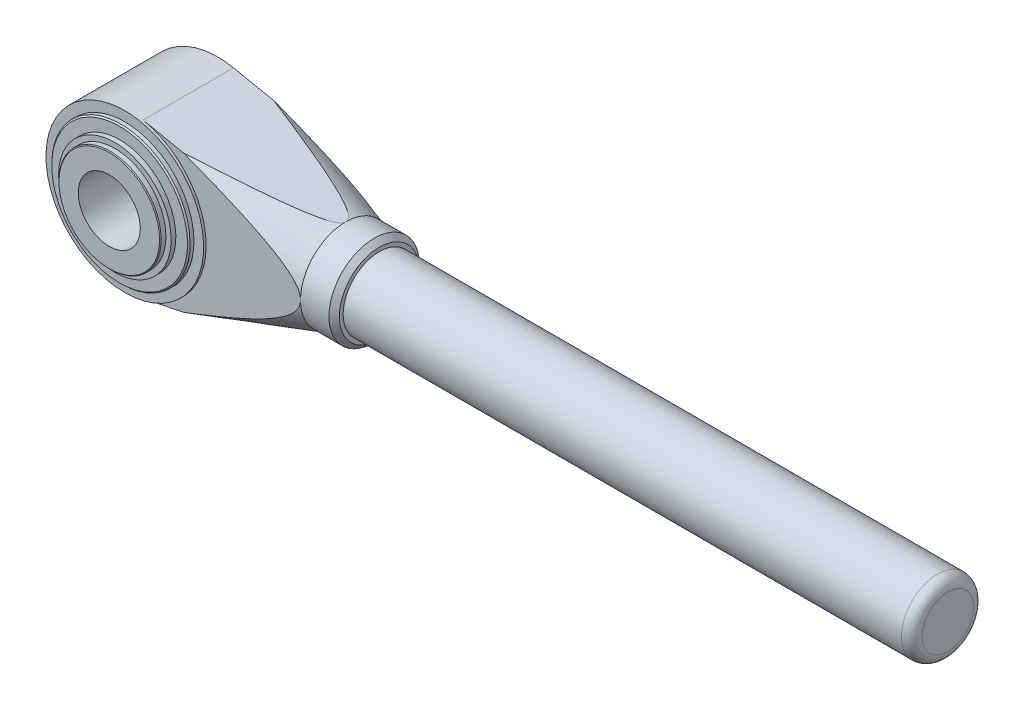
ISO-10303-21;
HEADER;
FILE_DESCRIPTION(('STEP AP214'),'2;1');
FILE_NAME('part.step','',(''),(''),'','','');
FILE_SCHEMA(('AUTOMOTIVE_DESIGN { 1 0 10303 214 1 1 1 1 }'));
ENDSEC;
DATA;
#1=APPLICATION_CONTEXT('core data for automotive mechanical design processes');
#2=APPLICATION_PROTOCOL_DEFINITION('international standard','automotive_design',2000,#1);
#3=PRODUCT_CONTEXT('',#1,'mechanical');
#4=PRODUCT('Part','Part','',(#3));
#5=PRODUCT_RELATED_PRODUCT_CATEGORY('part','',(#4));
#6=PRODUCT_DEFINITION_FORMATION('','',#4);
#7=PRODUCT_DEFINITION_CONTEXT('part definition',#1,'design');
#8=PRODUCT_DEFINITION('design','',#6,#7);
#9=PRODUCT_DEFINITION_SHAPE('','',#8);
#10=(LENGTH_UNIT() NAMED_UNIT(*) SI_UNIT(.MILLI.,.METRE.));
#11=(NAMED_UNIT(*) PLANE_ANGLE_UNIT() SI_UNIT($,.RADIAN.));
#12=(NAMED_UNIT(*) SI_UNIT($,.STERADIAN.) SOLID_ANGLE_UNIT());
#13=UNCERTAINTY_MEASURE_WITH_UNIT(LENGTH_MEASURE(1.E-05),#10,'distance_accuracy_value','');
#14=(GEOMETRIC_REPRESENTATION_CONTEXT(3) GLOBAL_UNCERTAINTY_ASSIGNED_CONTEXT((#13)) GLOBAL_UNIT_ASSIGNED_CONTEXT((#10,
#11,#12)) REPRESENTATION_CONTEXT('',''));
#15=CARTESIAN_POINT('',(0.,0.,0.));
#16=DIRECTION('',(0.,0.,1.));
#17=DIRECTION('',(1.,0.,0.));
#18=AXIS2_PLACEMENT_3D('',#15,#16,#17);
#19=CARTESIAN_POINT('',(0.,0.,40.0161705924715));
#20=DIRECTION('',(0.,0.,1.));
#21=DIRECTION('',(1.,0.,0.));
#22=AXIS2_PLACEMENT_3D('',#19,#20,#21);
#23=PLANE('',#22);
#24=DIRECTION('',(-0.979945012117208,-0.199268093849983,0.));
#25=VECTOR('',#24,1.);
#26=CARTESIAN_POINT('',(67.,-17.5000000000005,40.0161705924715));
#27=LINE('',#26,#25);
#28=CARTESIAN_POINT('',(21.703315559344,-26.7109086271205,40.0161705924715));
#29=VERTEX_POINT('',#28);
#30=CARTESIAN_POINT('',(6.07767686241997,-29.888322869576,40.0161705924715));
#31=VERTEX_POINT('',#30);
#32=EDGE_CURVE('E149',#29,#31,#27,.T.);
#33=ORIENTED_EDGE('',*,*,#32,.F.);
#34=CARTESIAN_POINT('',(-20.620989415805,-41.912333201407,40.0161705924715));
#35=CARTESIAN_POINT('',(-18.7210017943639,-41.2562501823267,40.0161705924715));
#36=CARTESIAN_POINT('',(-16.8217013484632,-40.5981709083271,40.0161705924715));
#37=CARTESIAN_POINT('',(-13.0247338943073,-39.2772899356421,40.0161705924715));
#38=CARTESIAN_POINT('',(-11.1270668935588,-38.614488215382,40.0161705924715));
#39=CARTESIAN_POINT('',(-7.33317946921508,-37.2832758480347,40.0161705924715));
#40=CARTESIAN_POINT('',(-5.43695951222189,-36.6148638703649,40.0161705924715));
#41=CARTESIAN_POINT('',(-1.64678627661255,-35.2716497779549,40.0161705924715));
#42=CARTESIAN_POINT('',(0.247167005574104,-34.5968476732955,40.0161705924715));
#43=CARTESIAN_POINT('',(3.99261487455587,-33.2539345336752,40.0161705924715));
#44=CARTESIAN_POINT('',(5.84416576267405,-32.5859806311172,40.0161705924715));
#45=CARTESIAN_POINT('',(9.5441265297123,-31.2414312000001,40.0161705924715));
#46=CARTESIAN_POINT('',(11.3925364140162,-30.5648356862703,40.0161705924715));
#47=CARTESIAN_POINT('',(15.085197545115,-29.2013160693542,40.0161705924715));
#48=CARTESIAN_POINT('',(16.9294494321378,-28.5143937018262,40.0161705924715));
#49=CARTESIAN_POINT('',(20.6131313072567,-27.1277531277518,40.0161705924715));
#50=CARTESIAN_POINT('',(22.4525613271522,-26.4280350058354,40.0161705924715));
#51=CARTESIAN_POINT('',(26.0017390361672,-25.0601977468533,40.0161705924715));
#52=CARTESIAN_POINT('',(27.7118872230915,-24.3931190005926,40.0161705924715));
#53=CARTESIAN_POINT('',(31.1258203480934,-23.041276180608,40.0161705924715));
#54=CARTESIAN_POINT('',(32.8296031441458,-22.3565066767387,40.0161705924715));
#55=CARTESIAN_POINT('',(35.3892529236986,-21.3079674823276,40.0161705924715));
#56=CARTESIAN_POINT('',(36.2485563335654,-20.9525831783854,40.0161705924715));
#57=CARTESIAN_POINT('',(37.9643684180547,-20.2351360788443,40.0161705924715));
#58=CARTESIAN_POINT('',(38.8208771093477,-19.8730733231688,40.0161705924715));
#59=CARTESIAN_POINT('',(40.5297503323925,-19.1415677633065,40.0161705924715));
#60=CARTESIAN_POINT('',(41.3821180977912,-18.7721325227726,40.0161705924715));
#61=CARTESIAN_POINT('',(43.0828651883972,-18.0242206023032,40.0161705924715));
#62=CARTESIAN_POINT('',(43.9312445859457,-17.6457440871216,40.0161705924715));
#63=CARTESIAN_POINT('',(45.6325384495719,-16.8738093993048,40.0161705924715));
#64=CARTESIAN_POINT('',(46.4853987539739,-16.4802315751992,40.0161705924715));
#65=CARTESIAN_POINT('',(48.1849799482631,-15.6798427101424,40.0161705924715));
#66=CARTESIAN_POINT('',(49.0317003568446,-15.2730306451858,40.0161705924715));
#67=CARTESIAN_POINT('',(50.7205177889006,-14.4416227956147,40.0161705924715));
#68=CARTESIAN_POINT('',(51.5625838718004,-14.016963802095,40.0161705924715));
#69=CARTESIAN_POINT('',(52.8176270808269,-13.3647123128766,40.0161705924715));
#70=CARTESIAN_POINT('',(53.2345871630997,-13.1447761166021,40.0161705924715));
#71=CARTESIAN_POINT('',(54.065401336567,-12.6991199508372,40.0161705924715));
#72=CARTESIAN_POINT('',(54.4792554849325,-12.473400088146,40.0161705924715));
#73=CARTESIAN_POINT('',(55.2966400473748,-12.019094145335,40.0161705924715));
#74=CARTESIAN_POINT('',(55.7002290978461,-11.7906137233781,40.0161705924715));
#75=CARTESIAN_POINT('',(56.5031925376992,-11.326378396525,40.0161705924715));
#76=CARTESIAN_POINT('',(56.9025670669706,-11.0906237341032,40.0161705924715));
#77=CARTESIAN_POINT('',(57.6966967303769,-10.6104448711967,40.0161705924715));
#78=CARTESIAN_POINT('',(58.0914461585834,-10.3660112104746,40.0161705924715));
#79=CARTESIAN_POINT('',(58.8747048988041,-9.8673492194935,40.0161705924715));
#80=CARTESIAN_POINT('',(59.263214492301,-9.61312133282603,40.0161705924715));
#81=CARTESIAN_POINT('',(60.0298340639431,-9.0949019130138,40.0161705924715));
#82=CARTESIAN_POINT('',(60.4079969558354,-8.83098894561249,40.0161705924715));
#83=CARTESIAN_POINT('',(61.1546422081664,-8.28956649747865,40.0161705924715));
#84=CARTESIAN_POINT('',(61.5231225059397,-8.01205415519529,40.0161705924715));
#85=CARTESIAN_POINT('',(62.2465600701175,-7.44133608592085,40.0161705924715));
#86=CARTESIAN_POINT('',(62.6015434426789,-7.14816360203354,40.0161705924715));
#87=CARTESIAN_POINT('',(63.2942856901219,-6.54223571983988,40.0161705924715));
#88=CARTESIAN_POINT('',(63.6320548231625,-6.2294922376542,40.0161705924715));
#89=CARTESIAN_POINT('',(64.05722927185,-5.80571935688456,40.0161705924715));
#90=CARTESIAN_POINT('',(64.1555057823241,-5.7055410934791,40.0161705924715));
#91=CARTESIAN_POINT('',(64.3495709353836,-5.50279022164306,40.0161705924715));
#92=CARTESIAN_POINT('',(64.4453594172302,-5.40021745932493,40.0161705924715));
#93=CARTESIAN_POINT('',(64.7286520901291,-5.08860845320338,40.0161705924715));
#94=CARTESIAN_POINT('',(64.9120072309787,-4.87575687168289,40.0161705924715));
#95=CARTESIAN_POINT('',(65.2644101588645,-4.43913179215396,40.0161705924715));
#96=CARTESIAN_POINT('',(65.4334861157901,-4.21538123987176,40.0161705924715));
#97=CARTESIAN_POINT('',(65.7538833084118,-3.75564756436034,40.0161705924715));
#98=CARTESIAN_POINT('',(65.9052131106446,-3.51967042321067,40.0161705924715));
#99=CARTESIAN_POINT('',(66.2307511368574,-2.95603967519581,40.0161705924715));
#100=CARTESIAN_POINT('',(66.3966069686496,-2.62335657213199,40.0161705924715));
#101=CARTESIAN_POINT('',(66.6054508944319,-2.10829803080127,40.0161705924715));
#102=CARTESIAN_POINT('',(66.6684119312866,-1.93392667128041,40.0161705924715));
#103=CARTESIAN_POINT('',(66.7792266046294,-1.58048428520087,40.0161705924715));
#104=CARTESIAN_POINT('',(66.8270884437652,-1.40141586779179,40.0161705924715));
#105=CARTESIAN_POINT('',(66.9065832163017,-1.03733547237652,40.0161705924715));
#106=CARTESIAN_POINT('',(66.9380060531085,-0.852277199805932,40.0161705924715));
#107=CARTESIAN_POINT('',(66.9824498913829,-0.479949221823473,40.0161705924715));
#108=CARTESIAN_POINT('',(66.9954717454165,-0.292679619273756,40.0161705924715));
#109=CARTESIAN_POINT('',(67.0025409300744,0.082140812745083,40.0161705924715));
#110=CARTESIAN_POINT('',(66.9965971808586,0.269691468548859,40.0161705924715));
#111=CARTESIAN_POINT('',(66.9660448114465,0.643210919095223,40.0161705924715));
#112=CARTESIAN_POINT('',(66.9414368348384,0.829179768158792,40.0161705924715));
#113=CARTESIAN_POINT('',(66.8509723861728,1.32743860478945,40.0161705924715));
#114=CARTESIAN_POINT('',(66.7682863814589,1.63675987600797,40.0161705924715));
#115=CARTESIAN_POINT('',(66.5598655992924,2.24022552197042,40.0161705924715));
#116=CARTESIAN_POINT('',(66.4341031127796,2.53435998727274,40.0161705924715));
#117=CARTESIAN_POINT('',(66.1634040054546,3.07655092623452,40.0161705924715));
#118=CARTESIAN_POINT('',(66.0217030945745,3.32625592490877,40.0161705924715));
#119=CARTESIAN_POINT('',(65.7168548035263,3.81232969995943,40.0161705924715));
#120=CARTESIAN_POINT('',(65.5536906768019,4.04868785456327,40.0161705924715));
#121=CARTESIAN_POINT('',(65.2101576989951,4.5095707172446,40.0161705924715));
#122=CARTESIAN_POINT('',(65.0297369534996,4.7340563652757,40.0161705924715));
#123=CARTESIAN_POINT('',(64.6557757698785,5.17160393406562,40.0161705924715));
#124=CARTESIAN_POINT('',(64.4622393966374,5.38466935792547,40.0161705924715));
#125=CARTESIAN_POINT('',(63.9634119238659,5.90682411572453,40.0161705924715));
#126=CARTESIAN_POINT('',(63.6514339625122,6.2095109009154,40.0161705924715));
#127=CARTESIAN_POINT('',(63.0101835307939,6.79610008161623,40.0161705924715));
#128=CARTESIAN_POINT('',(62.6809011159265,7.07999145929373,40.0161705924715));
#129=CARTESIAN_POINT('',(62.0087971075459,7.63264277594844,40.0161705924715));
#130=CARTESIAN_POINT('',(61.6659488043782,7.90137004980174,40.0161705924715));
#131=CARTESIAN_POINT('',(60.9704403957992,8.42558172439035,40.0161705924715));
#132=CARTESIAN_POINT('',(60.6177823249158,8.68106884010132,40.0161705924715));
#133=CARTESIAN_POINT('',(59.9023462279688,9.18255934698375,40.0161705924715));
#134=CARTESIAN_POINT('',(59.5395168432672,9.42848918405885,40.0161705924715));
#135=CARTESIAN_POINT('',(58.8075306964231,9.91074768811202,40.0161705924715));
#136=CARTESIAN_POINT('',(58.4383736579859,10.1470759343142,40.0161705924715));
#137=CARTESIAN_POINT('',(57.6953990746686,10.6111512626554,40.0161705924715));
#138=CARTESIAN_POINT('',(57.3215883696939,10.8389093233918,40.0161705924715));
#139=CARTESIAN_POINT('',(56.5697160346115,11.2872484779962,40.0161705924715));
#140=CARTESIAN_POINT('',(56.1916545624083,11.507829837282,40.0161705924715));
#141=CARTESIAN_POINT('',(55.3762239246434,11.9746176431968,40.0161705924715));
#142=CARTESIAN_POINT('',(54.9382900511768,12.2198365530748,40.0161705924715));
#143=CARTESIAN_POINT('',(54.0584893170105,12.7031246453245,40.0161705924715));
#144=CARTESIAN_POINT('',(53.6166223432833,12.941193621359,40.0161705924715));
#145=CARTESIAN_POINT('',(52.2859744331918,13.6461164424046,40.0161705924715));
#146=CARTESIAN_POINT('',(51.3922422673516,14.1036319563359,40.0161705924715));
#147=CARTESIAN_POINT('',(49.5946812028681,14.9994536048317,40.0161705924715));
#148=CARTESIAN_POINT('',(48.6908472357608,15.4377494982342,40.0161705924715));
#149=CARTESIAN_POINT('',(46.8758420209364,16.2986995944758,40.0161705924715));
#150=CARTESIAN_POINT('',(45.9646712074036,16.7213547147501,40.0161705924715));
#151=CARTESIAN_POINT('',(44.1346042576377,17.5547747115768,40.0161705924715));
#152=CARTESIAN_POINT('',(43.2156958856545,17.9655126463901,40.0161705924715));
#153=CARTESIAN_POINT('',(41.3731857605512,18.7763362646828,40.0161705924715));
#154=CARTESIAN_POINT('',(40.4495839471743,19.1764218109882,40.0161705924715));
#155=CARTESIAN_POINT('',(38.5988172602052,19.9674953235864,40.0161705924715));
#156=CARTESIAN_POINT('',(37.6716535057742,20.358485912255,40.0161705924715));
#157=CARTESIAN_POINT('',(35.8141424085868,21.1328087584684,40.0161705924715));
#158=CARTESIAN_POINT('',(34.8837950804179,21.5161410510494,40.0161705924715));
#159=CARTESIAN_POINT('',(33.0219997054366,22.2755629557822,40.0161705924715));
#160=CARTESIAN_POINT('',(32.0905562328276,22.6516637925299,40.0161705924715));
#161=CARTESIAN_POINT('',(30.2253787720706,23.3981458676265,40.0161705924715));
#162=CARTESIAN_POINT('',(29.2916447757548,23.7685270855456,40.0161705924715));
#163=CARTESIAN_POINT('',(26.4873779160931,24.872230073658,40.0161705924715));
#164=CARTESIAN_POINT('',(24.6138968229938,25.5980638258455,40.0161705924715));
#165=CARTESIAN_POINT('',(20.8632665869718,27.0332501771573,40.0161705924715));
#166=CARTESIAN_POINT('',(18.9861246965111,27.7426217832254,40.0161705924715));
#167=CARTESIAN_POINT('',(16.166930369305,28.7972876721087,40.0161705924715));
#168=CARTESIAN_POINT('',(15.2266294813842,29.1472737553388,40.0161705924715));
#169=CARTESIAN_POINT('',(13.3449795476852,29.8444175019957,40.0161705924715));
#170=CARTESIAN_POINT('',(12.4036305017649,30.1915751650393,40.0161705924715));
#171=CARTESIAN_POINT('',(10.0298486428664,31.0633413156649,40.0161705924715));
#172=CARTESIAN_POINT('',(8.5968006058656,31.5862747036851,40.0161705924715));
#173=CARTESIAN_POINT('',(5.72884856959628,32.6270290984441,40.0161705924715));
#174=CARTESIAN_POINT('',(4.2939445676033,33.1448500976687,40.0161705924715));
#175=CARTESIAN_POINT('',(-0.0131732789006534,34.6916576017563,40.0161705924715));
#176=CARTESIAN_POINT('',(-2.88777971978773,35.7139837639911,40.0161705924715));
#177=CARTESIAN_POINT('',(-8.64192790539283,37.7449158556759,40.0161705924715));
#178=CARTESIAN_POINT('',(-11.5214698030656,38.7535213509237,40.0161705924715));
#179=CARTESIAN_POINT('',(-17.2843501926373,40.7597955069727,40.0161705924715));
#180=CARTESIAN_POINT('',(-20.1676886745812,41.7574641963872,40.0161705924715));
#181=CARTESIAN_POINT('',(-25.9392441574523,43.7445943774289,40.0161705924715));
#182=CARTESIAN_POINT('',(-28.827463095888,44.7340502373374,40.0161705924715));
#183=CARTESIAN_POINT('',(-34.6063815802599,46.7056929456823,40.0161705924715));
#184=CARTESIAN_POINT('',(-37.4970811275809,47.687879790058,40.0161705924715));
#185=CARTESIAN_POINT('',(-43.2804806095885,49.6461885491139,40.0161705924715));
#186=CARTESIAN_POINT('',(-46.1731805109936,50.6223105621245,40.0161705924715));
#187=CARTESIAN_POINT('',(-51.9602939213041,52.5694631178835,40.0161705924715));
#188=CARTESIAN_POINT('',(-54.8547074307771,53.5404936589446,40.0161705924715));
#189=CARTESIAN_POINT('',(-60.6137707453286,55.4677814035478,40.0161705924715));
#190=CARTESIAN_POINT('',(-63.4784050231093,56.4240850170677,40.0161705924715));
#191=CARTESIAN_POINT('',(-69.2088873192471,58.3330492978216,40.0161705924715));
#192=CARTESIAN_POINT('',(-72.0747353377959,59.2857099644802,40.0161705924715));
#193=CARTESIAN_POINT('',(-80.6738701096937,62.1389918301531,40.0161705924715));
#194=CARTESIAN_POINT('',(-86.4087196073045,64.0349035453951,40.0161705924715));
#195=CARTESIAN_POINT('',(-97.8770203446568,67.8156448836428,40.0161705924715));
#196=CARTESIAN_POINT('',(-103.610469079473,69.7004821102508,40.0161705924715));
#197=CARTESIAN_POINT('',(-112.2124699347,72.5220951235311,40.0161705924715));
#198=CARTESIAN_POINT('',(-115.080098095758,73.4616890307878,40.0161705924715));
#199=CARTESIAN_POINT('',(-120.815905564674,75.3391916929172,40.0161705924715));
#200=CARTESIAN_POINT('',(-123.68408487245,76.2771004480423,40.0161705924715));
#201=CARTESIAN_POINT('',(-126.55250777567,77.2142635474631,40.0161705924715));
#202=B_SPLINE_CURVE_WITH_KNOTS('',3,(#34,#35,#36,#37,#38,#39,#40,#41,#42,#43,#44,#45,#46,#47,
#48,#49,#50,#51,#52,#53,#54,#55,#56,#57,#58,#59,#60,#61,#62,#63,#64,#65,#66,#67,#68,#69,#70,#71,
#72,#73,#74,#75,#76,#77,#78,#79,#80,#81,#82,#83,#84,#85,#86,#87,#88,#89,#90,#91,#92,#93,#94,#95,
#96,#97,#98,#99,#100,#101,#102,#103,#104,#105,#106,#107,#108,#109,#110,#111,#112,#113,#114,#115,
#116,#117,#118,#119,#120,#121,#122,#123,#124,#125,#126,#127,#128,#129,#130,#131,#132,#133,#134,
#135,#136,#137,#138,#139,#140,#141,#142,#143,#144,#145,#146,#147,#148,#149,#150,#151,#152,#153,
#154,#155,#156,#157,#158,#159,#160,#161,#162,#163,#164,#165,#166,#167,#168,#169,#170,#171,#172,
#173,#174,#175,#176,#177,#178,#179,#180,#181,#182,#183,#184,#185,#186,#187,#188,#189,#190,#191,
#192,#193,#194,#195,#196,#197,#198,#199,#200,#201),.UNSPECIFIED.,.F.,.F.,(4,2,2,2,2,2,2,2,2,2,2,
2,2,2,2,2,2,2,2,2,2,2,2,2,2,2,2,2,2,2,2,2,2,2,2,2,2,2,2,2,2,2,2,2,2,2,2,2,2,2,2,2,2,2,2,2,2,2,2,
2,2,2,2,2,2,2,2,2,2,2,2,2,2,2,2,2,2,2,2,2,2,2,2,4),(0.,6.03022422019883,12.0604760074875,
18.0922008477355,24.123916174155,30.0289495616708,35.9339728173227,41.8380144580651,
47.7420170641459,53.2488901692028,58.7574741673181,61.5471298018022,64.3367687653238,
67.1236795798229,69.9105396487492,72.7283284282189,75.5463357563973,78.3753410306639,
79.7895354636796,81.2037038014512,82.5949643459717,83.9861785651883,85.3789588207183,
86.7716760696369,88.1548788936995,89.5383740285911,90.9190407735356,92.2988749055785,
92.7198457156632,93.140843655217,93.9831608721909,94.8237755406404,95.6639827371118,
96.7750604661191,97.3306777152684,97.8859926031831,98.4482411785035,99.0104637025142,
99.5724218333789,100.134360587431,101.09078019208,102.047816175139,102.907843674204,
103.768546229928,104.631923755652,105.495034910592,106.798022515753,108.101767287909,
109.408220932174,110.714405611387,112.02919408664,113.344040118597,114.657140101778,
115.970191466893,117.475855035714,118.981562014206,121.993305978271,125.006635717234,
128.019788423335,131.03929262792,134.058835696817,137.077497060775,140.096144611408,
143.109650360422,146.123166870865,152.15057752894,158.170642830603,161.180606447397,
164.190570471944,168.766995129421,173.34342651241,182.496331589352,191.649525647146,
200.802695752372,209.961695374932,219.120700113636,228.279555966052,237.438414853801,
246.49853426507,255.558655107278,273.678985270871,291.784928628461,300.837836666,
309.890743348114),.UNSPECIFIED.);
#203=CARTESIAN_POINT('',(67.,0.,40.0161705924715));
#204=VERTEX_POINT('',#203);
#205=EDGE_CURVE('E238',#29,#204,#202,.T.);
#206=ORIENTED_EDGE('',*,*,#205,.T.);
#207=CARTESIAN_POINT('',(21.703315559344,26.71090862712,40.0161705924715));
#208=VERTEX_POINT('',#207);
#209=EDGE_CURVE('E80',#204,#208,#202,.T.);
#210=ORIENTED_EDGE('',*,*,#209,.T.);
#211=DIRECTION('',(-0.979945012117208,0.199268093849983,0.));
#212=VECTOR('',#211,1.);
#213=CARTESIAN_POINT('',(67.,17.5,40.0161705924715));
#214=LINE('',#213,#212);
#215=CARTESIAN_POINT('',(6.07767686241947,29.888322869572,40.0161705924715));
#216=VERTEX_POINT('',#215);
#217=EDGE_CURVE('E102',#208,#216,#214,.T.);
#218=ORIENTED_EDGE('',*,*,#217,.T.);
#219=CARTESIAN_POINT('',(0.,-3.99680288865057E-12,40.0161705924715));
#220=DIRECTION('',(0.,0.,1.));
#221=DIRECTION('',(1.,0.,0.));
#222=AXIS2_PLACEMENT_3D('',#219,#220,#221);
#223=CIRCLE('',#222,30.5);
#224=EDGE_CURVE('E134',#216,#31,#223,.F.);
#225=ORIENTED_EDGE('',*,*,#224,.T.);
#226=EDGE_LOOP('',(#33,#206,#210,#218,#225));
#227=FACE_BOUND('',#226,.T.);
#228=ADVANCED_FACE('F15',(#227),#23,.T.);
#229=CARTESIAN_POINT('',(67.,17.5,40.0161705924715));
#230=DIRECTION('',(-0.199268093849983,-0.979945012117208,0.));
#231=DIRECTION('',(0.979945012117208,-0.199268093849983,0.));
#232=AXIS2_PLACEMENT_3D('',#229,#230,#231);
#233=PLANE('',#232);
#234=CARTESIAN_POINT('',(21.7025776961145,26.7110586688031,5.01597059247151));
#235=CARTESIAN_POINT('',(23.1573136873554,26.415243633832,5.41034984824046));
#236=CARTESIAN_POINT('',(24.6115002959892,26.1195403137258,5.80685919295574));
#237=CARTESIAN_POINT('',(27.5185205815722,25.5284087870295,6.60548468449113));
#238=CARTESIAN_POINT('',(28.9713541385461,25.2329806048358,7.00760128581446));
#239=CARTESIAN_POINT('',(31.8719365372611,24.6431581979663,7.81781892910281));
#240=CARTESIAN_POINT('',(33.3196894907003,24.3487631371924,8.22590461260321));
#241=CARTESIAN_POINT('',(36.2126900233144,23.7604824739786,9.05085561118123));
#242=CARTESIAN_POINT('',(37.6579377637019,23.4665968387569,9.46772033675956));
#243=CARTESIAN_POINT('',(40.5454331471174,22.8794356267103,10.3130662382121));
#244=CARTESIAN_POINT('',(41.9876802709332,22.5861601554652,10.7415492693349));
#245=CARTESIAN_POINT('',(44.1477434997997,22.1469195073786,11.396184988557));
#246=CARTESIAN_POINT('',(44.8672861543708,22.0006032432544,11.6164050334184));
#247=CARTESIAN_POINT('',(46.3049625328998,21.7082572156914,12.0615788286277));
#248=CARTESIAN_POINT('',(47.0230962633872,21.5622274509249,12.2865325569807));
#249=CARTESIAN_POINT('',(48.4597768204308,21.2700839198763,12.7428188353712));
#250=CARTESIAN_POINT('',(49.1783184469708,21.1239712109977,12.9741684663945));
#251=CARTESIAN_POINT('',(50.6131880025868,20.8321959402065,13.4438960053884));
#252=CARTESIAN_POINT('',(51.3295159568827,20.6865333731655,13.6822738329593));
#253=CARTESIAN_POINT('',(52.7589360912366,20.395866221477,14.1677005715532));
#254=CARTESIAN_POINT('',(53.4720297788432,20.2508613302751,14.4147448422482));
#255=CARTESIAN_POINT('',(54.8943407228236,19.96163980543,14.9201242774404));
#256=CARTESIAN_POINT('',(55.6035581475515,19.8174231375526,15.1784589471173));
#257=CARTESIAN_POINT('',(57.0192936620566,19.5295387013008,15.7111009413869));
#258=CARTESIAN_POINT('',(57.7257916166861,19.3858750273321,15.9854645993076));
#259=CARTESIAN_POINT('',(58.7798533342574,19.1715355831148,16.413042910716));
#260=CARTESIAN_POINT('',(59.1304973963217,19.1002334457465,16.5583459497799));
#261=CARTESIAN_POINT('',(59.8291385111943,18.958167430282,16.8553979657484));
#262=CARTESIAN_POINT('',(60.1771357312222,18.8874035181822,17.0071465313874));
#263=CARTESIAN_POINT('',(60.8691253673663,18.7466900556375,17.3183223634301));
#264=CARTESIAN_POINT('',(61.2131235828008,18.6767393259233,17.4777361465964));
#265=CARTESIAN_POINT('',(61.8965003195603,18.5377772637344,17.8065462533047));
#266=CARTESIAN_POINT('',(62.2358793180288,18.4687658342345,17.9759415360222));
#267=CARTESIAN_POINT('',(62.9074340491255,18.3322077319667,18.327387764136));
#268=CARTESIAN_POINT('',(63.239623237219,18.2646583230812,18.5094117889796));
#269=CARTESIAN_POINT('',(63.8941944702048,18.1315537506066,18.8908577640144));
#270=CARTESIAN_POINT('',(64.2165830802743,18.0659972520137,19.0902677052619));
#271=CARTESIAN_POINT('',(64.6896817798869,17.9697944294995,19.4091836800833));
#272=CARTESIAN_POINT('',(64.8463932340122,17.9379277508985,19.5193926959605));
#273=CARTESIAN_POINT('',(65.1543633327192,17.8753032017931,19.7477797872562));
#274=CARTESIAN_POINT('',(65.3056180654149,17.8445461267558,19.8659634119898));
#275=CARTESIAN_POINT('',(65.599471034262,17.7847922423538,20.1113845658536));
#276=CARTESIAN_POINT('',(65.742115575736,17.7557860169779,20.2385638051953));
#277=CARTESIAN_POINT('',(66.0160805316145,17.7000762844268,20.5049272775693));
#278=CARTESIAN_POINT('',(66.1474170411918,17.6733695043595,20.6440938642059));
#279=CARTESIAN_POINT('',(66.3619232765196,17.6297504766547,20.9004137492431));
#280=CARTESIAN_POINT('',(66.4488740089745,17.6120693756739,21.0142325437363));
#281=CARTESIAN_POINT('',(66.6094232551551,17.5794222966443,21.251686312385));
#282=CARTESIAN_POINT('',(66.6830064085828,17.5644594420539,21.3753323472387));
#283=CARTESIAN_POINT('',(66.8120978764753,17.538209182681,21.6346462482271));
#284=CARTESIAN_POINT('',(66.8673312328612,17.5269776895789,21.7704613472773));
#285=CARTESIAN_POINT('',(66.9510247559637,17.5099589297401,22.0503148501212));
#286=CARTESIAN_POINT('',(66.9795748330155,17.5041533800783,22.1943238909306));
#287=CARTESIAN_POINT('',(67.0036542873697,17.4992569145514,22.4697797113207));
#288=CARTESIAN_POINT('',(67.0023773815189,17.4995165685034,22.6009304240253));
#289=CARTESIAN_POINT('',(66.974809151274,17.5051224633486,22.8605268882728));
#290=CARTESIAN_POINT('',(66.94848413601,17.5104755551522,22.9889687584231));
#291=CARTESIAN_POINT('',(66.8688357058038,17.526671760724,23.2585538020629));
#292=CARTESIAN_POINT('',(66.8119524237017,17.5382387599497,23.3985689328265));
#293=CARTESIAN_POINT('',(66.6773848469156,17.5656025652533,23.6676950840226));
#294=CARTESIAN_POINT('',(66.5996583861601,17.5814079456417,23.7967832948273));
#295=CARTESIAN_POINT('',(66.4374544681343,17.6143914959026,24.0331653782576));
#296=CARTESIAN_POINT('',(66.3542268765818,17.6313155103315,24.1413741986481));
#297=CARTESIAN_POINT('',(66.1790221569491,17.6669427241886,24.3502203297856));
#298=CARTESIAN_POINT('',(66.0870370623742,17.6856475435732,24.4508505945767));
#299=CARTESIAN_POINT('',(65.8964101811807,17.7244107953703,24.645809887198));
#300=CARTESIAN_POINT('',(65.7977504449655,17.7444728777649,24.7401204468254));
#301=CARTESIAN_POINT('',(65.595628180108,17.785573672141,24.9230767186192));
#302=CARTESIAN_POINT('',(65.4921678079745,17.8066119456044,25.0117249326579));
#303=CARTESIAN_POINT('',(65.1970732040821,17.8666183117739,25.2534492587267));
#304=CARTESIAN_POINT('',(65.0012532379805,17.9064375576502,25.401194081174));
#305=CARTESIAN_POINT('',(64.6016023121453,17.9877050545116,25.6850186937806));
#306=CARTESIAN_POINT('',(64.3977659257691,18.0291544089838,25.8210903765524));
#307=CARTESIAN_POINT('',(63.9840719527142,18.1132775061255,26.08432344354));
#308=CARTESIAN_POINT('',(63.7742025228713,18.1559536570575,26.2114653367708));
#309=CARTESIAN_POINT('',(63.3503181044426,18.2421489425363,26.4583646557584));
#310=CARTESIAN_POINT('',(63.1363024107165,18.2856682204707,26.5781208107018));
#311=CARTESIAN_POINT('',(62.4872834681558,18.417643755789,26.9296587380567));
#312=CARTESIAN_POINT('',(62.0475429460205,18.507063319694,27.1523354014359));
#313=CARTESIAN_POINT('',(61.3824770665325,18.6423019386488,27.4734465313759));
#314=CARTESIAN_POINT('',(61.160035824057,18.6875345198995,27.5782645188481));
#315=CARTESIAN_POINT('',(60.7135266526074,18.7783304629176,27.7842265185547));
#316=CARTESIAN_POINT('',(60.4894587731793,18.82389381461,27.8853706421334));
#317=CARTESIAN_POINT('',(59.821609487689,18.9596984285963,28.1812606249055));
#318=CARTESIAN_POINT('',(59.3758957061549,19.0503326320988,28.371459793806));
#319=CARTESIAN_POINT('',(58.4806979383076,19.232367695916,28.7424180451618));
#320=CARTESIAN_POINT('',(58.0312136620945,19.3237686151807,28.92317639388));
#321=CARTESIAN_POINT('',(57.1293003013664,19.5071692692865,29.2772036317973));
#322=CARTESIAN_POINT('',(56.6768705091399,19.5991691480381,29.4504706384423));
#323=CARTESIAN_POINT('',(55.769791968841,19.783620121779,29.7908580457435));
#324=CARTESIAN_POINT('',(55.3151431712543,19.876071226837,29.9579783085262));
#325=CARTESIAN_POINT('',(53.9473217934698,20.1542125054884,30.4521934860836));
#326=CARTESIAN_POINT('',(53.0315055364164,20.3404402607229,30.7716668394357));
#327=CARTESIAN_POINT('',(51.1952966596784,20.7138263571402,31.3960266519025));
#328=CARTESIAN_POINT('',(50.2749047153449,20.9009845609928,31.7009151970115));
#329=CARTESIAN_POINT('',(48.4339640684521,21.2753328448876,32.2986713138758));
#330=CARTESIAN_POINT('',(47.5134273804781,21.4625204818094,32.5915775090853));
#331=CARTESIAN_POINT('',(45.6697856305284,21.837418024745,33.1689406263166));
#332=CARTESIAN_POINT('',(44.7466804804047,22.0251279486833,33.4533972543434));
#333=CARTESIAN_POINT('',(42.8991104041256,22.4008243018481,34.0153803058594));
#334=CARTESIAN_POINT('',(41.9746467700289,22.5888104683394,34.2929111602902));
#335=CARTESIAN_POINT('',(40.1241547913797,22.9651009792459,34.8424901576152));
#336=CARTESIAN_POINT('',(39.1981264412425,23.1534053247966,35.1145382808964));
#337=CARTESIAN_POINT('',(36.8953979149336,23.6216564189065,35.7849537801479));
#338=CARTESIAN_POINT('',(35.5179364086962,23.9017579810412,36.1805967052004));
#339=CARTESIAN_POINT('',(32.7606600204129,24.4624396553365,36.9642576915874));
#340=CARTESIAN_POINT('',(31.3808447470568,24.7430198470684,37.352274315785));
#341=CARTESIAN_POINT('',(28.618557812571,25.3047203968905,38.1224982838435));
#342=CARTESIAN_POINT('',(27.2360849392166,25.5858410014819,38.5047010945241));
#343=CARTESIAN_POINT('',(24.4701005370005,26.1482934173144,39.2640384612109));
#344=CARTESIAN_POINT('',(23.0865892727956,26.4296251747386,39.6411740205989));
#345=CARTESIAN_POINT('',(21.702577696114,26.7110586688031,40.0163705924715));
#346=B_SPLINE_CURVE_WITH_KNOTS('',3,(#234,#235,#236,#237,#238,#239,#240,#241,#242,#243,#244,
#245,#246,#247,#248,#249,#250,#251,#252,#253,#254,#255,#256,#257,#258,#259,#260,#261,#262,#263,
#264,#265,#266,#267,#268,#269,#270,#271,#272,#273,#274,#275,#276,#277,#278,#279,#280,#281,#282,
#283,#284,#285,#286,#287,#288,#289,#290,#291,#292,#293,#294,#295,#296,#297,#298,#299,#300,#301,
#302,#303,#304,#305,#306,#307,#308,#309,#310,#311,#312,#313,#314,#315,#316,#317,#318,#319,#320,
#321,#322,#323,#324,#325,#326,#327,#328,#329,#330,#331,#332,#333,#334,#335,#336,#337,#338,#339,
#340,#341,#342,#343,#344,#345),.UNSPECIFIED.,.F.,.F.,(4,2,2,2,2,2,2,2,2,2,2,2,2,2,2,2,2,2,2,2,2,
2,2,2,2,2,2,2,2,2,2,2,2,2,2,2,2,2,2,2,2,2,2,2,2,2,2,2,2,2,2,2,2,2,2,4),(0.,4.6080082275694,
9.21639215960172,13.8144914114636,18.4122828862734,23.0108129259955,25.310544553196,
27.6102654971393,29.9168714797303,32.2234510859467,34.5288139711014,36.8340759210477,
39.1479938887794,40.3065375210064,41.4650073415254,42.6215090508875,43.7778903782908,
44.9318782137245,46.085075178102,46.6675473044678,47.2504290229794,47.8298295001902,
48.4083911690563,48.8406251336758,49.2733526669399,49.7122990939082,50.1497610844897,
50.5406198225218,50.9320050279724,51.3842123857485,51.8373415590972,52.2494124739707,
52.661861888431,53.0754683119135,53.4888907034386,54.2337905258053,54.9792035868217,
55.7261961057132,56.4733167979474,57.9755337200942,58.7255997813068,59.4756430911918,
60.9544971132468,62.4334659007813,63.91280421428,65.3921756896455,68.3549485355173,
71.3172963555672,74.2691905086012,77.2211872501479,80.1712442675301,83.1213118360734,
87.5020928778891,91.8836916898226,96.2685478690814,100.652522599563),.UNSPECIFIED.);
#347=CARTESIAN_POINT('',(21.7033155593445,26.71090862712,5.01617059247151));
#348=VERTEX_POINT('',#347);
#349=CARTESIAN_POINT('',(67.,17.5,22.5161705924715));
#350=VERTEX_POINT('',#349);
#351=EDGE_CURVE('E90',#348,#350,#346,.T.);
#352=ORIENTED_EDGE('',*,*,#351,.F.);
#353=DIRECTION('',(-0.979945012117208,0.199268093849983,0.));
#354=VECTOR('',#353,1.);
#355=CARTESIAN_POINT('',(67.,17.5,5.01617059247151));
#356=LINE('',#355,#354);
#357=CARTESIAN_POINT('',(6.07767686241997,29.888322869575,5.01617059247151));
#358=VERTEX_POINT('',#357);
#359=EDGE_CURVE('E138',#348,#358,#356,.T.);
#360=ORIENTED_EDGE('',*,*,#359,.T.);
#361=DIRECTION('',(0.,0.,-1.));
#362=VECTOR('',#361,1.);
#363=CARTESIAN_POINT('',(6.07767686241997,29.888322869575,40.0161705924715));
#364=LINE('',#363,#362);
#365=EDGE_CURVE('E113',#216,#358,#364,.T.);
#366=ORIENTED_EDGE('',*,*,#365,.F.);
#367=ORIENTED_EDGE('',*,*,#217,.F.);
#368=EDGE_CURVE('E78',#350,#208,#346,.T.);
#369=ORIENTED_EDGE('',*,*,#368,.F.);
#370=EDGE_LOOP('',(#352,#360,#366,#367,#369));
#371=FACE_BOUND('',#370,.T.);
#372=ADVANCED_FACE('F100',(#371),#233,.F.);
#373=CARTESIAN_POINT('',(67.,-17.5000000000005,40.0161705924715));
#374=DIRECTION('',(0.199268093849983,-0.979945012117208,0.));
#375=DIRECTION('',(0.979945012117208,0.199268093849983,0.));
#376=AXIS2_PLACEMENT_3D('',#373,#374,#375);
#377=PLANE('',#376);
#378=DIRECTION('',(-0.979945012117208,-0.199268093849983,0.));
#379=VECTOR('',#378,1.);
#380=CARTESIAN_POINT('',(67.,-17.5000000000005,5.01617059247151));
#381=LINE('',#380,#379);
#382=CARTESIAN_POINT('',(21.7033155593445,-26.7109086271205,5.01617059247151));
#383=VERTEX_POINT('',#382);
#384=CARTESIAN_POINT('',(6.07767686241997,-29.888322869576,5.01617059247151));
#385=VERTEX_POINT('',#384);
#386=EDGE_CURVE('E168',#383,#385,#381,.T.);
#387=ORIENTED_EDGE('',*,*,#386,.F.);
#388=CARTESIAN_POINT('',(21.702577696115,-26.7110586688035,5.01597059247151));
#389=CARTESIAN_POINT('',(23.1573136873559,-26.4152436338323,5.41034984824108));
#390=CARTESIAN_POINT('',(24.6115002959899,-26.1195403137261,5.80685919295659));
#391=CARTESIAN_POINT('',(27.5185205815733,-25.5284087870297,6.60548468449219));
#392=CARTESIAN_POINT('',(28.9713541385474,-25.232980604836,7.0076012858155));
#393=CARTESIAN_POINT('',(31.8719365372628,-24.6431581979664,7.8178189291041));
#394=CARTESIAN_POINT('',(33.3196894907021,-24.3487631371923,8.22590461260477));
#395=CARTESIAN_POINT('',(36.2126900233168,-23.7604824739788,9.05085561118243));
#396=CARTESIAN_POINT('',(37.6579377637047,-23.4665968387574,9.46772033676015));
#397=CARTESIAN_POINT('',(40.5454331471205,-22.8794356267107,10.3130662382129));
#398=CARTESIAN_POINT('',(41.9876802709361,-22.5861601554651,10.7415492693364));
#399=CARTESIAN_POINT('',(44.1477434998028,-22.1469195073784,11.396184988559));
#400=CARTESIAN_POINT('',(44.8672861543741,-22.0006032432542,11.6164050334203));
#401=CARTESIAN_POINT('',(46.3049625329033,-21.7082572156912,12.0615788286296));
#402=CARTESIAN_POINT('',(47.0230962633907,-21.5622274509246,12.2865325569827));
#403=CARTESIAN_POINT('',(48.4597768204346,-21.2700839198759,12.7428188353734));
#404=CARTESIAN_POINT('',(49.1783184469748,-21.1239712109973,12.9741684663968));
#405=CARTESIAN_POINT('',(50.613188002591,-20.8321959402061,13.4438960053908));
#406=CARTESIAN_POINT('',(51.3295159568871,-20.6865333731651,13.6822738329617));
#407=CARTESIAN_POINT('',(52.7589360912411,-20.3958662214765,14.1677005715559));
#408=CARTESIAN_POINT('',(53.4720297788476,-20.2508613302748,14.4147448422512));
#409=CARTESIAN_POINT('',(54.8943407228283,-19.9616398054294,14.9201242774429));
#410=CARTESIAN_POINT('',(55.6035581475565,-19.8174231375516,15.1784589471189));
#411=CARTESIAN_POINT('',(57.0192936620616,-19.5295387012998,15.7111009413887));
#412=CARTESIAN_POINT('',(57.7257916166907,-19.3858750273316,15.9854645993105));
#413=CARTESIAN_POINT('',(58.7798533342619,-19.1715355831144,16.4130429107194));
#414=CARTESIAN_POINT('',(59.1304973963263,-19.1002334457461,16.5583459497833));
#415=CARTESIAN_POINT('',(59.829138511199,-18.9581674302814,16.8553979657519));
#416=CARTESIAN_POINT('',(60.177135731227,-18.8874035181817,17.0071465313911));
#417=CARTESIAN_POINT('',(60.8691253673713,-18.746690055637,17.318322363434));
#418=CARTESIAN_POINT('',(61.2131235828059,-18.6767393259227,17.4777361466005));
#419=CARTESIAN_POINT('',(61.8965003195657,-18.5377772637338,17.8065462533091));
#420=CARTESIAN_POINT('',(62.2358793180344,-18.4687658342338,17.9759415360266));
#421=CARTESIAN_POINT('',(62.9074340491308,-18.3322077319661,18.3273877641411));
#422=CARTESIAN_POINT('',(63.2396232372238,-18.2646583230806,18.5094117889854));
#423=CARTESIAN_POINT('',(63.8941944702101,-18.131553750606,18.8908577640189));
#424=CARTESIAN_POINT('',(64.2165830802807,-18.0659972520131,19.0902677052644));
#425=CARTESIAN_POINT('',(64.689681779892,-17.969794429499,19.4091836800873));
#426=CARTESIAN_POINT('',(64.8463932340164,-17.9379277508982,19.5193926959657));
#427=CARTESIAN_POINT('',(65.1543633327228,-17.8753032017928,19.7477797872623));
#428=CARTESIAN_POINT('',(65.3056180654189,-17.8445461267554,19.8659634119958));
#429=CARTESIAN_POINT('',(65.5994710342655,-17.7847922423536,20.1113845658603));
#430=CARTESIAN_POINT('',(65.7421155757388,-17.7557860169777,20.238563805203));
#431=CARTESIAN_POINT('',(66.0160805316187,-17.7000762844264,20.5049272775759));
#432=CARTESIAN_POINT('',(66.147417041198,-17.6733695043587,20.6440938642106));
#433=CARTESIAN_POINT('',(66.3619232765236,-17.6297504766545,20.9004137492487));
#434=CARTESIAN_POINT('',(66.4488740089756,-17.6120693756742,21.0142325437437));
#435=CARTESIAN_POINT('',(66.6094232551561,-17.5794222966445,21.2516863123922));
#436=CARTESIAN_POINT('',(66.6830064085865,-17.5644594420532,21.375332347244));
#437=CARTESIAN_POINT('',(66.8120978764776,-17.5382091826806,21.6346462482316));
#438=CARTESIAN_POINT('',(66.8673312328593,-17.5269776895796,21.7704613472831));
#439=CARTESIAN_POINT('',(66.9510247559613,-17.5099589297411,22.0503148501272));
#440=CARTESIAN_POINT('',(66.9795748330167,-17.5041533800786,22.1943238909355));
#441=CARTESIAN_POINT('',(67.0036542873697,-17.499256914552,22.4697797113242));
#442=CARTESIAN_POINT('',(67.0023773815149,-17.4995165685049,22.6009304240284));
#443=CARTESIAN_POINT('',(66.9748091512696,-17.5051224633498,22.8605268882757));
#444=CARTESIAN_POINT('',(66.9484841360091,-17.5104755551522,22.9889687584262));
#445=CARTESIAN_POINT('',(66.8688357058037,-17.5266717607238,23.2585538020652));
#446=CARTESIAN_POINT('',(66.8119524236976,-17.5382387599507,23.3985689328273));
#447=CARTESIAN_POINT('',(66.6773848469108,-17.565602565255,23.6676950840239));
#448=CARTESIAN_POINT('',(66.5996583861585,-17.5814079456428,23.7967832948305));
#449=CARTESIAN_POINT('',(66.4374544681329,-17.6143914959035,24.0331653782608));
#450=CARTESIAN_POINT('',(66.3542268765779,-17.6313155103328,24.1413741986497));
#451=CARTESIAN_POINT('',(66.1790221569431,-17.6669427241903,24.3502203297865));
#452=CARTESIAN_POINT('',(66.0870370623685,-17.6856475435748,24.4508505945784));
#453=CARTESIAN_POINT('',(65.8964101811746,-17.724410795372,24.6458098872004));
#454=CARTESIAN_POINT('',(65.7977504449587,-17.7444728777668,24.7401204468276));
#455=CARTESIAN_POINT('',(65.5956281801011,-17.7855736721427,24.9230767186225));
#456=CARTESIAN_POINT('',(65.4921678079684,-17.8066119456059,25.0117249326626));
#457=CARTESIAN_POINT('',(65.1970732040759,-17.8666183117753,25.253449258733));
#458=CARTESIAN_POINT('',(65.0012532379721,-17.9064375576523,25.4011940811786));
#459=CARTESIAN_POINT('',(64.6016023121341,-17.9877050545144,25.6850186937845));
#460=CARTESIAN_POINT('',(64.3977659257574,-18.0291544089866,25.8210903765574));
#461=CARTESIAN_POINT('',(63.9840719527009,-18.1132775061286,26.0843234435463));
#462=CARTESIAN_POINT('',(63.7742025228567,-18.1559536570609,26.2114653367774));
#463=CARTESIAN_POINT('',(63.3503181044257,-18.2421489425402,26.4583646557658));
#464=CARTESIAN_POINT('',(63.1363024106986,-18.2856682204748,26.5781208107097));
#465=CARTESIAN_POINT('',(62.4872834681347,-18.4176437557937,26.9296587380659));
#466=CARTESIAN_POINT('',(62.0475429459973,-18.5070633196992,27.152335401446));
#467=CARTESIAN_POINT('',(61.382477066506,-18.6423019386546,27.4734465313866));
#468=CARTESIAN_POINT('',(61.1600358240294,-18.6875345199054,27.5782645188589));
#469=CARTESIAN_POINT('',(60.7135266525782,-18.778330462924,27.7842265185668));
#470=CARTESIAN_POINT('',(60.4894587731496,-18.8238938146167,27.8853706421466));
#471=CARTESIAN_POINT('',(59.8216094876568,-18.9596984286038,28.1812606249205));
#472=CARTESIAN_POINT('',(59.37589570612,-19.0503326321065,28.37145979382));
#473=CARTESIAN_POINT('',(58.4806979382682,-19.2323676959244,28.7424180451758));
#474=CARTESIAN_POINT('',(58.0312136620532,-19.3237686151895,28.9231763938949));
#475=CARTESIAN_POINT('',(57.1293003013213,-19.5071692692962,29.2772036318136));
#476=CARTESIAN_POINT('',(56.6768705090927,-19.5991691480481,29.450470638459));
#477=CARTESIAN_POINT('',(55.7697919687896,-19.7836201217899,29.7908580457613));
#478=CARTESIAN_POINT('',(55.3151431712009,-19.8760712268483,29.9579783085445));
#479=CARTESIAN_POINT('',(53.9473217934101,-20.154212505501,30.4521934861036));
#480=CARTESIAN_POINT('',(53.0315055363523,-20.3404402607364,30.7716668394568));
#481=CARTESIAN_POINT('',(51.1952966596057,-20.7138263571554,31.3960266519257));
#482=CARTESIAN_POINT('',(50.2749047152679,-20.900984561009,31.7009151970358));
#483=CARTESIAN_POINT('',(48.4339640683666,-21.2753328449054,32.2986713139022));
#484=CARTESIAN_POINT('',(47.5134273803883,-21.4625204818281,32.5915775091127));
#485=CARTESIAN_POINT('',(45.6697856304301,-21.8374180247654,33.1689406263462));
#486=CARTESIAN_POINT('',(44.7466804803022,-22.0251279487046,33.453397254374));
#487=CARTESIAN_POINT('',(42.8991104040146,-22.4008243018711,34.0153803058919));
#488=CARTESIAN_POINT('',(41.9746467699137,-22.5888104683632,34.2929111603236));
#489=CARTESIAN_POINT('',(40.1241547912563,-22.9651009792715,34.8424901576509));
#490=CARTESIAN_POINT('',(39.1981264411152,-23.1534053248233,35.1145382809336));
#491=CARTESIAN_POINT('',(36.8953979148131,-23.6216564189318,35.7849537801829));
#492=CARTESIAN_POINT('',(35.5179364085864,-23.9017579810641,36.1805967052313));
#493=CARTESIAN_POINT('',(32.7606600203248,-24.4624396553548,36.9642576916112));
#494=CARTESIAN_POINT('',(31.3808447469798,-24.7430198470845,37.3522743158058));
#495=CARTESIAN_POINT('',(28.6185578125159,-25.3047203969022,38.1224982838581));
#496=CARTESIAN_POINT('',(27.2360849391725,-25.5858410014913,38.5047010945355));
#497=CARTESIAN_POINT('',(24.4701005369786,-26.1482934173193,39.2640384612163));
#498=CARTESIAN_POINT('',(23.0865892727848,-26.4296251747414,39.6411740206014));
#499=CARTESIAN_POINT('',(21.7025776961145,-26.711058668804,40.0163705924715));
#500=B_SPLINE_CURVE_WITH_KNOTS('',3,(#388,#389,#390,#391,#392,#393,#394,#395,#396,#397,#398,
#399,#400,#401,#402,#403,#404,#405,#406,#407,#408,#409,#410,#411,#412,#413,#414,#415,#416,#417,
#418,#419,#420,#421,#422,#423,#424,#425,#426,#427,#428,#429,#430,#431,#432,#433,#434,#435,#436,
#437,#438,#439,#440,#441,#442,#443,#444,#445,#446,#447,#448,#449,#450,#451,#452,#453,#454,#455,
#456,#457,#458,#459,#460,#461,#462,#463,#464,#465,#466,#467,#468,#469,#470,#471,#472,#473,#474,
#475,#476,#477,#478,#479,#480,#481,#482,#483,#484,#485,#486,#487,#488,#489,#490,#491,#492,#493,
#494,#495,#496,#497,#498,#499),.UNSPECIFIED.,.F.,.F.,(4,2,2,2,2,2,2,2,2,2,2,2,2,2,2,2,2,2,2,2,2,
2,2,2,2,2,2,2,2,2,2,2,2,2,2,2,2,2,2,2,2,2,2,2,2,2,2,2,2,2,2,2,2,2,2,4),(0.,4.60800822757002,
9.21639215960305,13.8144914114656,18.4122828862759,23.0108129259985,25.3105445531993,
27.610265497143,29.9168714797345,32.2234510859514,34.5288139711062,36.8340759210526,
39.1479938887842,40.3065375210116,41.4650073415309,42.6215090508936,43.7778903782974,
44.9318782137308,46.0850751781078,46.6675473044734,47.2504290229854,47.8298295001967,
48.4083911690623,48.840625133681,49.2733526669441,49.7122990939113,50.1497610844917,
50.5406198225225,50.9320050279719,51.3842123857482,51.8373415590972,52.2494124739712,
52.6618618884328,53.0754683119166,53.4888907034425,54.2337905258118,54.9792035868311,
55.7261961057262,56.473316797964,57.9755337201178,58.7255997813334,59.4756430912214,
60.9544971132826,62.4334659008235,63.9128042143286,65.3921756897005,68.3549485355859,
71.3172963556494,74.2691905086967,77.2211872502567,80.171244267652,83.1213118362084,
87.5020928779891,91.8836916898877,96.2685478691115,100.652522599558),.UNSPECIFIED.);
#501=CARTESIAN_POINT('',(67.,-17.5000000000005,22.5161705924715));
#502=VERTEX_POINT('',#501);
#503=EDGE_CURVE('E97',#383,#502,#500,.T.);
#504=ORIENTED_EDGE('',*,*,#503,.T.);
#505=EDGE_CURVE('E96',#502,#29,#500,.T.);
#506=ORIENTED_EDGE('',*,*,#505,.T.);
#507=ORIENTED_EDGE('',*,*,#32,.T.);
#508=DIRECTION('',(0.,0.,-1.));
#509=VECTOR('',#508,1.);
#510=CARTESIAN_POINT('',(6.07767686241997,-29.888322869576,40.0161705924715));
#511=LINE('',#510,#509);
#512=EDGE_CURVE('E154',#31,#385,#511,.T.);
#513=ORIENTED_EDGE('',*,*,#512,.T.);
#514=EDGE_LOOP('',(#387,#504,#506,#507,#513));
#515=FACE_BOUND('',#514,.T.);
#516=ADVANCED_FACE('F273',(#515),#377,.T.);
#517=CARTESIAN_POINT('',(0.,0.,5.01617059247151));
#518=DIRECTION('',(0.,0.,1.));
#519=DIRECTION('',(1.,0.,0.));
#520=AXIS2_PLACEMENT_3D('',#517,#518,#519);
#521=PLANE('',#520);
#522=CARTESIAN_POINT('',(0.,-3.99680288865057E-12,5.01617059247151));
#523=DIRECTION('',(0.,0.,1.));
#524=DIRECTION('',(1.,0.,0.));
#525=AXIS2_PLACEMENT_3D('',#522,#523,#524);
#526=CIRCLE('',#525,26.7631302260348);
#527=CARTESIAN_POINT('',(26.7631302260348,-3.99680288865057E-12,5.01617059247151));
#528=VERTEX_POINT('',#527);
#529=EDGE_CURVE('E135',#528,#528,#526,.T.);
#530=ORIENTED_EDGE('',*,*,#529,.T.);
#531=EDGE_LOOP('',(#530));
#532=FACE_BOUND('',#531,.T.);
#533=CARTESIAN_POINT('',(-20.8683523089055,-41.9977333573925,5.01617059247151));
#534=CARTESIAN_POINT('',(-18.9592258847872,-41.3386933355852,5.01617059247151));
#535=CARTESIAN_POINT('',(-17.0507887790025,-40.67765021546,5.01617059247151));
#536=CARTESIAN_POINT('',(-13.2355538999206,-39.350822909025,5.01617059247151));
#537=CARTESIAN_POINT('',(-11.3287561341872,-38.6850387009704,5.01617059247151));
#538=CARTESIAN_POINT('',(-7.51653208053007,-37.3478088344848,5.01617059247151));
#539=CARTESIAN_POINT('',(-5.61110634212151,-36.6763616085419,5.01617059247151));
#540=CARTESIAN_POINT('',(-1.8025318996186,-35.3270458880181,5.01617059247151));
#541=CARTESIAN_POINT('',(0.10061680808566,-34.6491774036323,5.01617059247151));
#542=CARTESIAN_POINT('',(3.85269857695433,-33.304295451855,5.01617059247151));
#543=CARTESIAN_POINT('',(5.70170436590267,-32.6374850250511,5.01617059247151));
#544=CARTESIAN_POINT('',(9.39659951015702,-31.295287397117,5.01617059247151));
#545=CARTESIAN_POINT('',(11.2424888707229,-30.6199002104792,5.01617059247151));
#546=CARTESIAN_POINT('',(14.9300678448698,-29.2589116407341,5.01617059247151));
#547=CARTESIAN_POINT('',(16.7717582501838,-28.5733124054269,5.01617059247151));
#548=CARTESIAN_POINT('',(20.4503594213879,-27.1894292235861,5.01617059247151));
#549=CARTESIAN_POINT('',(22.287270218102,-26.4911453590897,5.01617059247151));
#550=CARTESIAN_POINT('',(25.8645107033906,-25.1135976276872,5.01617059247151));
#551=CARTESIAN_POINT('',(27.6051330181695,-24.4350957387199,5.01617059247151));
#552=CARTESIAN_POINT('',(30.2110618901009,-23.4036388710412,5.01617059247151));
#553=CARTESIAN_POINT('',(31.0790524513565,-23.0574617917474,5.01617059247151));
#554=CARTESIAN_POINT('',(32.8129623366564,-22.3599617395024,5.01617059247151));
#555=CARTESIAN_POINT('',(33.6788816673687,-22.0086387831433,5.01617059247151));
#556=CARTESIAN_POINT('',(35.4228131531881,-21.2941868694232,5.01617059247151));
#557=CARTESIAN_POINT('',(36.3007847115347,-20.9309587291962,5.01617059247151));
#558=CARTESIAN_POINT('',(38.0537986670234,-20.197509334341,5.01617059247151));
#559=CARTESIAN_POINT('',(38.9288410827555,-19.8272881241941,5.01617059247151));
#560=CARTESIAN_POINT('',(40.674290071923,-19.0791989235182,5.01617059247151));
#561=CARTESIAN_POINT('',(41.5447012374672,-18.7013416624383,5.01617059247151));
#562=CARTESIAN_POINT('',(43.2812999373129,-17.9360883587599,5.01617059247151));
#563=CARTESIAN_POINT('',(44.1474875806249,-17.5486925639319,5.01617059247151));
#564=CARTESIAN_POINT('',(45.8866041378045,-16.7571152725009,5.01617059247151));
#565=CARTESIAN_POINT('',(46.7594614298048,-16.3527760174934,5.01617059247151));
#566=CARTESIAN_POINT('',(48.4985849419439,-15.5298942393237,5.01617059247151));
#567=CARTESIAN_POINT('',(49.3648504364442,-15.1113501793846,5.01617059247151));
#568=CARTESIAN_POINT('',(51.0932988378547,-14.2545591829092,5.01617059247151));
#569=CARTESIAN_POINT('',(51.9554365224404,-13.8162204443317,5.01617059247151));
#570=CARTESIAN_POINT('',(53.2397104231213,-13.142043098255,5.01617059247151));
#571=CARTESIAN_POINT('',(53.6662456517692,-12.9145767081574,5.01617059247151));
#572=CARTESIAN_POINT('',(54.5158590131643,-12.4532845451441,5.01617059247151));
#573=CARTESIAN_POINT('',(54.9389372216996,-12.2194589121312,5.01617059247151));
#574=CARTESIAN_POINT('',(55.7718004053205,-11.7497200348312,5.01617059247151));
#575=CARTESIAN_POINT('',(56.1816738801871,-11.5139639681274,5.01617059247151));
#576=CARTESIAN_POINT('',(56.9967279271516,-11.0344343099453,5.01617059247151));
#577=CARTESIAN_POINT('',(57.4019083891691,-10.7906605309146,5.01617059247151));
#578=CARTESIAN_POINT('',(58.2071611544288,-10.2934258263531,5.01617059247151));
#579=CARTESIAN_POINT('',(58.6072246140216,-10.0399505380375,5.01617059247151));
#580=CARTESIAN_POINT('',(59.4001992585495,-9.52206304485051,5.01617059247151));
#581=CARTESIAN_POINT('',(59.7931109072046,-9.2576515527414,5.01617059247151));
#582=CARTESIAN_POINT('',(60.5663401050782,-8.71831736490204,5.01617059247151));
#583=CARTESIAN_POINT('',(60.946740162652,-8.44351346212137,5.01617059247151));
#584=CARTESIAN_POINT('',(61.6961917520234,-7.87850633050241,5.01617059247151));
#585=CARTESIAN_POINT('',(62.0652398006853,-7.58829844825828,5.01617059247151));
#586=CARTESIAN_POINT('',(62.7870031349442,-6.99016266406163,5.01617059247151));
#587=CARTESIAN_POINT('',(63.1397617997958,-6.68228738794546,5.01617059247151));
#588=CARTESIAN_POINT('',(63.8242163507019,-6.04408946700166,5.01617059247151));
#589=CARTESIAN_POINT('',(64.1559299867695,-5.7137862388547,5.01617059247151));
#590=CARTESIAN_POINT('',(64.5587586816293,-5.27619648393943,5.01617059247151));
#591=CARTESIAN_POINT('',(64.6437726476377,-5.18162538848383,5.01617059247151));
#592=CARTESIAN_POINT('',(64.8113400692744,-4.99031080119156,5.01617059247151));
#593=CARTESIAN_POINT('',(64.8938932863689,-4.89356710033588,5.01617059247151));
#594=CARTESIAN_POINT('',(65.1375420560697,-4.59982789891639,5.01617059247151));
#595=CARTESIAN_POINT('',(65.2945525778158,-4.3994041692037,5.01617059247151));
#596=CARTESIAN_POINT('',(65.594745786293,-3.9889723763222,5.01617059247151));
#597=CARTESIAN_POINT('',(65.7379550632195,-3.77898393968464,5.01617059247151));
#598=CARTESIAN_POINT('',(66.0075156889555,-3.3485715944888,5.01617059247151));
#599=CARTESIAN_POINT('',(66.1338741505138,-3.12815214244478,5.01617059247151));
#600=CARTESIAN_POINT('',(66.412981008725,-2.58446060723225,5.01617059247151));
#601=CARTESIAN_POINT('',(66.555623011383,-2.2557557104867,5.01617059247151));
#602=CARTESIAN_POINT('',(66.7289083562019,-1.74900478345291,5.01617059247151));
#603=CARTESIAN_POINT('',(66.7798926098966,-1.57779344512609,5.01617059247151));
#604=CARTESIAN_POINT('',(66.8668075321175,-1.23162374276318,5.01617059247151));
#605=CARTESIAN_POINT('',(66.9027460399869,-1.05666738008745,5.01617059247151));
#606=CARTESIAN_POINT('',(66.9585948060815,-0.702499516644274,5.01617059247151));
#607=CARTESIAN_POINT('',(66.9783503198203,-0.52326342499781,5.01617059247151));
#608=CARTESIAN_POINT('',(67.0004925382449,-0.163717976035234,5.01617059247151));
#609=CARTESIAN_POINT('',(67.0028800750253,0.016591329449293,5.01617059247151));
#610=CARTESIAN_POINT('',(66.9901878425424,0.376627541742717,5.01617059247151));
#611=CARTESIAN_POINT('',(66.9751043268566,0.556354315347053,5.01617059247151));
#612=CARTESIAN_POINT('',(66.9280652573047,0.913577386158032,5.01617059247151));
#613=CARTESIAN_POINT('',(66.8961078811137,1.09107344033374,5.01617059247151));
#614=CARTESIAN_POINT('',(66.8125253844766,1.45994402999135,5.01617059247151));
#615=CARTESIAN_POINT('',(66.7592622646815,1.65094632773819,5.01617059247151));
#616=CARTESIAN_POINT('',(66.6357753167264,2.02743638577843,5.01617059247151));
#617=CARTESIAN_POINT('',(66.5655401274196,2.21292035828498,5.01617059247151));
#618=CARTESIAN_POINT('',(66.3326297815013,2.76016887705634,5.01617059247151));
#619=CARTESIAN_POINT('',(66.1477869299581,3.11257977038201,5.01617059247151));
#620=CARTESIAN_POINT('',(65.764081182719,3.74447918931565,5.01617059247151));
#621=CARTESIAN_POINT('',(65.5705761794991,4.02735536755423,5.01617059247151));
#622=CARTESIAN_POINT('',(65.1598761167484,4.57559343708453,5.01617059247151));
#623=CARTESIAN_POINT('',(64.9426614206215,4.84094051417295,5.01617059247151));
#624=CARTESIAN_POINT('',(64.4897623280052,5.35687015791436,5.01617059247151));
#625=CARTESIAN_POINT('',(64.2540151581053,5.60739702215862,5.01617059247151));
#626=CARTESIAN_POINT('',(63.8902751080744,5.97289102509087,5.01617059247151));
#627=CARTESIAN_POINT('',(63.7673660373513,6.09298460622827,5.01617059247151));
#628=CARTESIAN_POINT('',(63.5185392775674,6.33001214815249,5.01617059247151));
#629=CARTESIAN_POINT('',(63.3926216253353,6.4469461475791,5.01617059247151));
#630=CARTESIAN_POINT('',(62.9906212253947,6.81176348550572,5.01617059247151));
#631=CARTESIAN_POINT('',(62.7096783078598,7.05430393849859,5.01617059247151));
#632=CARTESIAN_POINT('',(62.1381613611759,7.52780570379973,5.01617059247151));
#633=CARTESIAN_POINT('',(61.8475850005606,7.75876417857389,5.01617059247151));
#634=CARTESIAN_POINT('',(61.2585601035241,8.21090024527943,5.01617059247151));
#635=CARTESIAN_POINT('',(60.9601052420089,8.43206957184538,5.01617059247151));
#636=CARTESIAN_POINT('',(60.3569887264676,8.86580330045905,5.01617059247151));
#637=CARTESIAN_POINT('',(60.0523265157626,9.07836692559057,5.01617059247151));
#638=CARTESIAN_POINT('',(59.4369784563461,9.49663151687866,5.01617059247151));
#639=CARTESIAN_POINT('',(59.1262770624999,9.70230956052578,5.01617059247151));
#640=CARTESIAN_POINT('',(58.5005918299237,10.1070556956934,5.01617059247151));
#641=CARTESIAN_POINT('',(58.1856077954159,10.3061234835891,5.01617059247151));
#642=CARTESIAN_POINT('',(57.2351921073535,10.8946615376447,5.01617059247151));
#643=CARTESIAN_POINT('',(56.5943569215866,11.2754261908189,5.01617059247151));
#644=CARTESIAN_POINT('',(55.6205271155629,11.8354492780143,5.01617059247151));
#645=CARTESIAN_POINT('',(55.2914217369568,12.0215593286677,5.01617059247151));
#646=CARTESIAN_POINT('',(54.6308609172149,12.3894894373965,5.01617059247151));
#647=CARTESIAN_POINT('',(54.2994057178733,12.5713099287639,5.01617059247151));
#648=CARTESIAN_POINT('',(53.301842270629,13.1110718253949,5.01617059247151));
#649=CARTESIAN_POINT('',(52.6326222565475,13.4632644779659,5.01617059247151));
#650=CARTESIAN_POINT('',(51.2892300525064,14.1542643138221,5.01617059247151));
#651=CARTESIAN_POINT('',(50.6150723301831,14.4930997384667,5.01617059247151));
#652=CARTESIAN_POINT('',(49.5999758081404,14.993454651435,5.01617059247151));
#653=CARTESIAN_POINT('',(49.2609742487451,15.1589198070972,5.01617059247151));
#654=CARTESIAN_POINT('',(48.5817980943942,15.4874275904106,5.01617059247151));
#655=CARTESIAN_POINT('',(48.2416234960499,15.6504702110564,5.01617059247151));
#656=CARTESIAN_POINT('',(47.2022113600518,16.1444776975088,5.01617059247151));
#657=CARTESIAN_POINT('',(46.5012749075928,16.4718715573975,5.01617059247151));
#658=CARTESIAN_POINT('',(45.0957170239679,17.1186623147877,5.01617059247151));
#659=CARTESIAN_POINT('',(44.3910955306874,17.4380590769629,5.01617059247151));
#660=CARTESIAN_POINT('',(42.9787233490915,18.069962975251,5.01617059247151));
#661=CARTESIAN_POINT('',(42.2709724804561,18.3824697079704,5.01617059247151));
#662=CARTESIAN_POINT('',(40.8528401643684,19.0014612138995,5.01617059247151));
#663=CARTESIAN_POINT('',(40.1424586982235,19.30794594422,5.01617059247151));
#664=CARTESIAN_POINT('',(38.0076052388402,20.2196443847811,5.01617059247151));
#665=CARTESIAN_POINT('',(36.5797562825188,20.8169546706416,5.01617059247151));
#666=CARTESIAN_POINT('',(33.7172542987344,21.9950418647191,5.01617059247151));
#667=CARTESIAN_POINT('',(32.2826011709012,22.5758185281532,5.01617059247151));
#668=CARTESIAN_POINT('',(30.1251777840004,23.4375547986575,5.01617059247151));
#669=CARTESIAN_POINT('',(29.4043985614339,23.7235128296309,5.01617059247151));
#670=CARTESIAN_POINT('',(27.9616497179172,24.2923904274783,5.01617059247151));
#671=CARTESIAN_POINT('',(27.2396801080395,24.5753100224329,5.01617059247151));
#672=CARTESIAN_POINT('',(25.0721539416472,25.4199588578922,5.01617059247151));
#673=CARTESIAN_POINT('',(23.6249930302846,25.977572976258,5.01617059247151));
#674=CARTESIAN_POINT('',(20.7274152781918,27.0836018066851,5.01617059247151));
#675=CARTESIAN_POINT('',(19.2769989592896,27.6320178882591,5.01617059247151));
#676=CARTESIAN_POINT('',(16.3732904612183,28.7211671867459,5.01617059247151));
#677=CARTESIAN_POINT('',(14.919998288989,29.2619004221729,5.01617059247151));
#678=CARTESIAN_POINT('',(12.1563355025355,30.2831189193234,5.01617059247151));
#679=CARTESIAN_POINT('',(10.8461942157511,30.7642253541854,5.01617059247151));
#680=CARTESIAN_POINT('',(8.22421931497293,31.7218059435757,5.01617059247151));
#681=CARTESIAN_POINT('',(6.91238569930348,32.1982800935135,5.01617059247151));
#682=CARTESIAN_POINT('',(2.97457403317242,33.6216616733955,5.01617059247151));
#683=CARTESIAN_POINT('',(0.346397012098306,34.5624870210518,5.01617059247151));
#684=CARTESIAN_POINT('',(-4.90608543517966,36.4284349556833,5.01617059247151));
#685=CARTESIAN_POINT('',(-7.53037650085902,37.3535980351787,5.01617059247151));
#686=CARTESIAN_POINT('',(-11.4694076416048,38.7336813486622,5.01617059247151));
#687=CARTESIAN_POINT('',(-12.7828119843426,39.192418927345,5.01617059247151));
#688=CARTESIAN_POINT('',(-15.410422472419,40.1075873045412,5.01617059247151));
#689=CARTESIAN_POINT('',(-16.7246286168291,40.56401810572,5.01617059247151));
#690=CARTESIAN_POINT('',(-18.0391929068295,41.019414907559,5.01617059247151));
#691=B_SPLINE_CURVE_WITH_KNOTS('',3,(#533,#534,#535,#536,#537,#538,#539,#540,#541,#542,#543,
#544,#545,#546,#547,#548,#549,#550,#551,#552,#553,#554,#555,#556,#557,#558,#559,#560,#561,#562,
#563,#564,#565,#566,#567,#568,#569,#570,#571,#572,#573,#574,#575,#576,#577,#578,#579,#580,#581,
#582,#583,#584,#585,#586,#587,#588,#589,#590,#591,#592,#593,#594,#595,#596,#597,#598,#599,#600,
#601,#602,#603,#604,#605,#606,#607,#608,#609,#610,#611,#612,#613,#614,#615,#616,#617,#618,#619,
#620,#621,#622,#623,#624,#625,#626,#627,#628,#629,#630,#631,#632,#633,#634,#635,#636,#637,#638,
#639,#640,#641,#642,#643,#644,#645,#646,#647,#648,#649,#650,#651,#652,#653,#654,#655,#656,#657,
#658,#659,#660,#661,#662,#663,#664,#665,#666,#667,#668,#669,#670,#671,#672,#673,#674,#675,#676,
#677,#678,#679,#680,#681,#682,#683,#684,#685,#686,#687,#688,#689,#690),.UNSPECIFIED.,.F.,.F.,(4,
2,2,2,2,2,2,2,2,2,2,2,2,2,2,2,2,2,2,2,2,2,2,2,2,2,2,2,2,2,2,2,2,2,2,2,2,2,2,2,2,2,2,2,2,2,2,2,2,
2,2,2,2,2,2,2,2,2,2,2,2,2,2,2,2,2,2,2,2,2,2,2,2,2,2,2,2,2,4),(0.,6.05903461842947,
12.1180970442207,18.1788955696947,24.2396844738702,30.1363716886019,36.0330489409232,
41.9285030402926,47.8239190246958,53.4283963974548,56.2318124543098,59.0352194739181,
61.8856178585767,64.7359981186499,67.5826189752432,70.4291659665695,73.3149446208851,
76.2010364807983,79.1022611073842,80.5524110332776,82.0025290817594,83.4209703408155,
84.8394448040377,86.2601073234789,87.680677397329,89.0882050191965,90.4961602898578,
91.9001198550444,93.3028790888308,93.6843416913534,94.0658411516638,94.8291665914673,
95.5909906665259,96.3524921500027,97.4230861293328,97.9584558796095,98.493546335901,
99.0336955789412,99.5738189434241,100.114058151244,100.65435571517,101.248309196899,
101.842661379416,103.031824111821,104.058663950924,105.086360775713,106.117702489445,
106.633178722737,107.148648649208,108.261687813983,109.374998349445,110.489231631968,
111.603565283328,112.721299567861,113.839085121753,116.074873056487,117.209105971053,
118.343223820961,120.611756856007,122.875203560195,124.006878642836,125.13855699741,
127.459371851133,129.780225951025,132.101215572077,134.422221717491,139.06532424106,
143.708495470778,146.034785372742,148.361053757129,153.013632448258,157.665512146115,
162.317380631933,166.504422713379,170.691468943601,179.065918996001,187.413676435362,
191.587310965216,195.760940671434),.UNSPECIFIED.);
#692=CARTESIAN_POINT('',(67.,0.,5.01617059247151));
#693=VERTEX_POINT('',#692);
#694=EDGE_CURVE('E9',#383,#693,#691,.T.);
#695=ORIENTED_EDGE('',*,*,#694,.F.);
#696=ORIENTED_EDGE('',*,*,#386,.T.);
#697=CARTESIAN_POINT('',(0.,0.,5.01617059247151));
#698=DIRECTION('',(0.,0.,1.));
#699=DIRECTION('',(1.,0.,0.));
#700=AXIS2_PLACEMENT_3D('',#697,#698,#699);
#701=CIRCLE('',#700,30.5);
#702=EDGE_CURVE('E158',#358,#385,#701,.T.);
#703=ORIENTED_EDGE('',*,*,#702,.F.);
#704=ORIENTED_EDGE('',*,*,#359,.F.);
#705=EDGE_CURVE('E19',#693,#348,#691,.T.);
#706=ORIENTED_EDGE('',*,*,#705,.F.);
#707=EDGE_LOOP('',(#695,#696,#703,#704,#706));
#708=FACE_BOUND('',#707,.T.);
#709=ADVANCED_FACE('F277',(#532,#708),#521,.F.);
#710=CARTESIAN_POINT('',(0.,0.,40.0161705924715));
#711=DIRECTION('',(0.,0.,-1.));
#712=DIRECTION('',(-1.,0.,0.));
#713=AXIS2_PLACEMENT_3D('',#710,#711,#712);
#714=CYLINDRICAL_SURFACE('',#713,30.5);
#715=ORIENTED_EDGE('',*,*,#365,.T.);
#716=ORIENTED_EDGE('',*,*,#702,.T.);
#717=ORIENTED_EDGE('',*,*,#512,.F.);
#718=ORIENTED_EDGE('',*,*,#224,.F.);
#719=EDGE_LOOP('',(#715,#716,#717,#718));
#720=FACE_BOUND('',#719,.T.);
#721=CARTESIAN_POINT('',(0.,-3.99680288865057E-12,41.));
#722=DIRECTION('',(0.,0.,1.));
#723=DIRECTION('',(0.,-1.,0.));
#724=AXIS2_PLACEMENT_3D('',#721,#722,#723);
#725=CIRCLE('',#724,30.5);
#726=CARTESIAN_POINT('',(0.,-30.500000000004,41.0000000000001));
#727=VERTEX_POINT('',#726);
#728=EDGE_CURVE('E139',#727,#727,#725,.T.);
#729=ORIENTED_EDGE('',*,*,#728,.F.);
#730=EDGE_LOOP('',(#729));
#731=FACE_BOUND('',#730,.T.);
#732=ADVANCED_FACE('F155',(#720,#731),#714,.T.);
#733=CARTESIAN_POINT('',(-20.7,-3.99680288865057E-12,0.));
#734=DIRECTION('',(0.,0.,-1.));
#735=DIRECTION('',(0.,1.,0.));
#736=AXIS2_PLACEMENT_3D('',#733,#734,#735);
#737=PLANE('',#736);
#738=CARTESIAN_POINT('',(0.,0.,0.));
#739=DIRECTION('',(0.,0.,1.));
#740=DIRECTION('',(1.,0.,0.));
#741=AXIS2_PLACEMENT_3D('',#738,#739,#740);
#742=CIRCLE('',#741,12.);
#743=CARTESIAN_POINT('',(12.,0.,0.));
#744=VERTEX_POINT('',#743);
#745=EDGE_CURVE('E271',#744,#744,#742,.T.);
#746=ORIENTED_EDGE('',*,*,#745,.T.);
#747=EDGE_LOOP('',(#746));
#748=FACE_BOUND('',#747,.T.);
#749=CARTESIAN_POINT('',(0.,-3.99680288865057E-12,0.));
#750=DIRECTION('',(0.,0.,1.));
#751=DIRECTION('',(0.,-1.,0.));
#752=AXIS2_PLACEMENT_3D('',#749,#750,#751);
#753=CIRCLE('',#752,20.6999999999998);
#754=CARTESIAN_POINT('',(0.,-20.7000000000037,0.));
#755=VERTEX_POINT('',#754);
#756=EDGE_CURVE('E202',#755,#755,#753,.T.);
#757=ORIENTED_EDGE('',*,*,#756,.F.);
#758=EDGE_LOOP('',(#757));
#759=FACE_BOUND('',#758,.T.);
#760=ADVANCED_FACE('F279',(#748,#759),#737,.T.);
#761=CARTESIAN_POINT('',(0.,-3.99680288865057E-12,0.300000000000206));
#762=DIRECTION('',(0.,0.,1.));
#763=DIRECTION('',(0.,-1.,0.));
#764=AXIS2_PLACEMENT_3D('',#761,#762,#763);
#765=CONICAL_SURFACE('',#764,21.,0.785398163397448);
#766=ORIENTED_EDGE('',*,*,#756,.T.);
#767=EDGE_LOOP('',(#766));
#768=FACE_BOUND('',#767,.T.);
#769=CARTESIAN_POINT('',(0.,-3.99680288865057E-12,0.300000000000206));
#770=DIRECTION('',(0.,0.,1.));
#771=DIRECTION('',(0.,-1.,0.));
#772=AXIS2_PLACEMENT_3D('',#769,#770,#771);
#773=CIRCLE('',#772,21.);
#774=CARTESIAN_POINT('',(0.,-21.000000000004,0.300000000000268));
#775=VERTEX_POINT('',#774);
#776=EDGE_CURVE('E198',#775,#775,#773,.T.);
#777=ORIENTED_EDGE('',*,*,#776,.F.);
#778=EDGE_LOOP('',(#777));
#779=FACE_BOUND('',#778,.T.);
#780=ADVANCED_FACE('F346',(#768,#779),#765,.T.);
#781=CARTESIAN_POINT('',(0.,-3.99680288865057E-12,52.));
#782=DIRECTION('',(0.,0.,1.));
#783=DIRECTION('',(0.,-1.,0.));
#784=AXIS2_PLACEMENT_3D('',#781,#782,#783);
#785=CYLINDRICAL_SURFACE('',#784,21.);
#786=ORIENTED_EDGE('',*,*,#776,.T.);
#787=EDGE_LOOP('',(#786));
#788=FACE_BOUND('',#787,.T.);
#789=CARTESIAN_POINT('',(0.,-3.99680288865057E-12,2.14999999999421));
#790=DIRECTION('',(0.,0.,1.));
#791=DIRECTION('',(0.,-1.,0.));
#792=AXIS2_PLACEMENT_3D('',#789,#790,#791);
#793=CIRCLE('',#792,21.);
#794=CARTESIAN_POINT('',(0.,-21.000000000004,2.14999999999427));
#795=VERTEX_POINT('',#794);
#796=EDGE_CURVE('E194',#795,#795,#793,.T.);
#797=ORIENTED_EDGE('',*,*,#796,.F.);
#798=EDGE_LOOP('',(#797));
#799=FACE_BOUND('',#798,.T.);
#800=ADVANCED_FACE('F355',(#788,#799),#785,.T.);
#801=CARTESIAN_POINT('',(-21.7631302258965,-3.99680288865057E-12,2.14999999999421));
#802=DIRECTION('',(0.,0.,-1.));
#803=DIRECTION('',(0.,1.,0.));
#804=AXIS2_PLACEMENT_3D('',#801,#802,#803);
#805=PLANE('',#804);
#806=ORIENTED_EDGE('',*,*,#796,.T.);
#807=EDGE_LOOP('',(#806));
#808=FACE_BOUND('',#807,.T.);
#809=CARTESIAN_POINT('',(0.,-3.99680288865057E-12,2.14999999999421));
#810=DIRECTION('',(0.,0.,1.));
#811=DIRECTION('',(0.,-1.,0.));
#812=AXIS2_PLACEMENT_3D('',#809,#810,#811);
#813=CIRCLE('',#812,21.7631302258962);
#814=CARTESIAN_POINT('',(0.,-21.7631302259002,2.14999999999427));
#815=VERTEX_POINT('',#814);
#816=EDGE_CURVE('E190',#815,#815,#813,.T.);
#817=ORIENTED_EDGE('',*,*,#816,.F.);
#818=EDGE_LOOP('',(#817));
#819=FACE_BOUND('',#818,.T.);
#820=ADVANCED_FACE('F364',(#808,#819),#805,.T.);
#821=CARTESIAN_POINT('',(0.,-3.99680288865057E-12,52.));
#822=DIRECTION('',(0.,0.,1.));
#823=DIRECTION('',(0.,-1.,0.));
#824=AXIS2_PLACEMENT_3D('',#821,#822,#823);
#825=CYLINDRICAL_SURFACE('',#824,21.7631302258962);
#826=ORIENTED_EDGE('',*,*,#816,.T.);
#827=EDGE_LOOP('',(#826));
#828=FACE_BOUND('',#827,.T.);
#829=CARTESIAN_POINT('',(0.,-3.99680288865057E-12,4.));
#830=DIRECTION('',(0.,0.,1.));
#831=DIRECTION('',(0.,-1.,0.));
#832=AXIS2_PLACEMENT_3D('',#829,#830,#831);
#833=CIRCLE('',#832,21.7631302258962);
#834=CARTESIAN_POINT('',(0.,-21.7631302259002,4.00000000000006));
#835=VERTEX_POINT('',#834);
#836=EDGE_CURVE('E186',#835,#835,#833,.T.);
#837=ORIENTED_EDGE('',*,*,#836,.F.);
#838=EDGE_LOOP('',(#837));
#839=FACE_BOUND('',#838,.T.);
#840=ADVANCED_FACE('F373',(#828,#839),#825,.T.);
#841=CARTESIAN_POINT('',(-26.263130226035,-3.99680288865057E-12,4.));
#842=DIRECTION('',(0.,0.,-1.));
#843=DIRECTION('',(0.,1.,0.));
#844=AXIS2_PLACEMENT_3D('',#841,#842,#843);
#845=PLANE('',#844);
#846=ORIENTED_EDGE('',*,*,#836,.T.);
#847=EDGE_LOOP('',(#846));
#848=FACE_BOUND('',#847,.T.);
#849=CARTESIAN_POINT('',(0.,-3.99680288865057E-12,4.));
#850=DIRECTION('',(0.,0.,1.));
#851=DIRECTION('',(0.,-1.,0.));
#852=AXIS2_PLACEMENT_3D('',#849,#850,#851);
#853=CIRCLE('',#852,26.2631302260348);
#854=CARTESIAN_POINT('',(0.,-26.2631302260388,4.00000000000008));
#855=VERTEX_POINT('',#854);
#856=EDGE_CURVE('E182',#855,#855,#853,.T.);
#857=ORIENTED_EDGE('',*,*,#856,.F.);
#858=EDGE_LOOP('',(#857));
#859=FACE_BOUND('',#858,.T.);
#860=ADVANCED_FACE('F382',(#848,#859),#845,.T.);
#861=CARTESIAN_POINT('',(0.,-3.99680288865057E-12,4.49999999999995));
#862=DIRECTION('',(0.,0.,1.));
#863=DIRECTION('',(0.,-1.,0.));
#864=AXIS2_PLACEMENT_3D('',#861,#862,#863);
#865=CONICAL_SURFACE('',#864,26.7631302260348,0.785398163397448);
#866=ORIENTED_EDGE('',*,*,#856,.T.);
#867=EDGE_LOOP('',(#866));
#868=FACE_BOUND('',#867,.T.);
#869=CARTESIAN_POINT('',(0.,-3.99680288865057E-12,4.49999999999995));
#870=DIRECTION('',(0.,0.,1.));
#871=DIRECTION('',(0.,-1.,0.));
#872=AXIS2_PLACEMENT_3D('',#869,#870,#871);
#873=CIRCLE('',#872,26.7631302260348);
#874=CARTESIAN_POINT('',(0.,-26.7631302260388,4.50000000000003));
#875=VERTEX_POINT('',#874);
#876=EDGE_CURVE('E178',#875,#875,#873,.T.);
#877=ORIENTED_EDGE('',*,*,#876,.F.);
#878=EDGE_LOOP('',(#877));
#879=FACE_BOUND('',#878,.T.);
#880=ADVANCED_FACE('F391',(#868,#879),#865,.T.);
#881=CARTESIAN_POINT('',(0.,-3.99680288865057E-12,52.));
#882=DIRECTION('',(0.,0.,1.));
#883=DIRECTION('',(0.,-1.,0.));
#884=AXIS2_PLACEMENT_3D('',#881,#882,#883);
#885=CYLINDRICAL_SURFACE('',#884,26.7631302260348);
#886=ORIENTED_EDGE('',*,*,#876,.T.);
#887=EDGE_LOOP('',(#886));
#888=FACE_BOUND('',#887,.T.);
#889=ORIENTED_EDGE('',*,*,#529,.F.);
#890=EDGE_LOOP('',(#889));
#891=FACE_BOUND('',#890,.T.);
#892=ADVANCED_FACE('F400',(#888,#891),#885,.T.);
#893=CARTESIAN_POINT('',(-26.763130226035,-3.99680288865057E-12,41.));
#894=DIRECTION('',(0.,0.,1.));
#895=DIRECTION('',(0.,-1.,0.));
#896=AXIS2_PLACEMENT_3D('',#893,#894,#895);
#897=PLANE('',#896);
#898=ORIENTED_EDGE('',*,*,#728,.T.);
#899=EDGE_LOOP('',(#898));
#900=FACE_BOUND('',#899,.T.);
#901=CARTESIAN_POINT('',(0.,-3.99680288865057E-12,41.));
#902=DIRECTION('',(0.,0.,1.));
#903=DIRECTION('',(0.,-1.,0.));
#904=AXIS2_PLACEMENT_3D('',#901,#902,#903);
#905=CIRCLE('',#904,26.7631302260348);
#906=CARTESIAN_POINT('',(0.,-26.7631302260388,41.0000000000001));
#907=VERTEX_POINT('',#906);
#908=EDGE_CURVE('E234',#907,#907,#905,.T.);
#909=ORIENTED_EDGE('',*,*,#908,.F.);
#910=EDGE_LOOP('',(#909));
#911=FACE_BOUND('',#910,.T.);
#912=ADVANCED_FACE('F409',(#900,#911),#897,.T.);
#913=CARTESIAN_POINT('',(-19.4631302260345,-3.99680288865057E-12,47.));
#914=DIRECTION('',(0.,0.,-1.));
#915=DIRECTION('',(0.,1.,0.));
#916=AXIS2_PLACEMENT_3D('',#913,#914,#915);
#917=PLANE('',#916);
#918=CARTESIAN_POINT('',(0.,0.,47.0000000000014));
#919=DIRECTION('',(0.,0.,1.));
#920=DIRECTION('',(1.,0.,0.));
#921=AXIS2_PLACEMENT_3D('',#918,#919,#920);
#922=CIRCLE('',#921,12.);
#923=CARTESIAN_POINT('',(12.,0.,47.0000000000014));
#924=VERTEX_POINT('',#923);
#925=EDGE_CURVE('E560',#924,#924,#922,.T.);
#926=ORIENTED_EDGE('',*,*,#925,.F.);
#927=EDGE_LOOP('',(#926));
#928=FACE_BOUND('',#927,.T.);
#929=CARTESIAN_POINT('',(0.,-3.99680288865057E-12,47.));
#930=DIRECTION('',(0.,0.,1.));
#931=DIRECTION('',(0.,-1.,0.));
#932=AXIS2_PLACEMENT_3D('',#929,#930,#931);
#933=CIRCLE('',#932,19.4631302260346);
#934=CARTESIAN_POINT('',(0.,-19.4631302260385,47.0000000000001));
#935=VERTEX_POINT('',#934);
#936=EDGE_CURVE('E206',#935,#935,#933,.T.);
#937=ORIENTED_EDGE('',*,*,#936,.T.);
#938=EDGE_LOOP('',(#937));
#939=FACE_BOUND('',#938,.T.);
#940=ADVANCED_FACE('F418',(#928,#939),#917,.F.);
#941=CARTESIAN_POINT('',(0.,-3.99680288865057E-12,46.7));
#942=DIRECTION('',(0.,0.,-1.));
#943=DIRECTION('',(0.,1.,0.));
#944=AXIS2_PLACEMENT_3D('',#941,#942,#943);
#945=CONICAL_SURFACE('',#944,19.7631302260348,0.785398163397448);
#946=ORIENTED_EDGE('',*,*,#936,.F.);
#947=EDGE_LOOP('',(#946));
#948=FACE_BOUND('',#947,.T.);
#949=CARTESIAN_POINT('',(0.,-3.99680288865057E-12,46.7));
#950=DIRECTION('',(0.,0.,1.));
#951=DIRECTION('',(0.,-1.,0.));
#952=AXIS2_PLACEMENT_3D('',#949,#950,#951);
#953=CIRCLE('',#952,19.7631302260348);
#954=CARTESIAN_POINT('',(0.,-19.7631302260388,46.7000000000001));
#955=VERTEX_POINT('',#954);
#956=EDGE_CURVE('E210',#955,#955,#953,.T.);
#957=ORIENTED_EDGE('',*,*,#956,.T.);
#958=EDGE_LOOP('',(#957));
#959=FACE_BOUND('',#958,.T.);
#960=ADVANCED_FACE('F427',(#948,#959),#945,.T.);
#961=CARTESIAN_POINT('',(0.,-3.99680288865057E-12,52.));
#962=DIRECTION('',(0.,0.,1.));
#963=DIRECTION('',(0.,-1.,0.));
#964=AXIS2_PLACEMENT_3D('',#961,#962,#963);
#965=CYLINDRICAL_SURFACE('',#964,19.7631302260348);
#966=ORIENTED_EDGE('',*,*,#956,.F.);
#967=EDGE_LOOP('',(#966));
#968=FACE_BOUND('',#967,.T.);
#969=CARTESIAN_POINT('',(0.,-3.99680288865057E-12,44.8500000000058));
#970=DIRECTION('',(0.,0.,1.));
#971=DIRECTION('',(0.,-1.,0.));
#972=AXIS2_PLACEMENT_3D('',#969,#970,#971);
#973=CIRCLE('',#972,19.7631302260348);
#974=CARTESIAN_POINT('',(0.,-19.7631302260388,44.8500000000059));
#975=VERTEX_POINT('',#974);
#976=EDGE_CURVE('E214',#975,#975,#973,.T.);
#977=ORIENTED_EDGE('',*,*,#976,.T.);
#978=EDGE_LOOP('',(#977));
#979=FACE_BOUND('',#978,.T.);
#980=ADVANCED_FACE('F436',(#968,#979),#965,.T.);
#981=CARTESIAN_POINT('',(-21.7631302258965,-3.99680288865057E-12,44.8500000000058));
#982=DIRECTION('',(0.,0.,-1.));
#983=DIRECTION('',(0.,1.,0.));
#984=AXIS2_PLACEMENT_3D('',#981,#982,#983);
#985=PLANE('',#984);
#986=ORIENTED_EDGE('',*,*,#976,.F.);
#987=EDGE_LOOP('',(#986));
#988=FACE_BOUND('',#987,.T.);
#989=CARTESIAN_POINT('',(0.,-3.99680288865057E-12,44.8500000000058));
#990=DIRECTION('',(0.,0.,1.));
#991=DIRECTION('',(0.,-1.,0.));
#992=AXIS2_PLACEMENT_3D('',#989,#990,#991);
#993=CIRCLE('',#992,21.7631302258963);
#994=CARTESIAN_POINT('',(0.,-21.7631302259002,44.8500000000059));
#995=VERTEX_POINT('',#994);
#996=EDGE_CURVE('E218',#995,#995,#993,.T.);
#997=ORIENTED_EDGE('',*,*,#996,.T.);
#998=EDGE_LOOP('',(#997));
#999=FACE_BOUND('',#998,.T.);
#1000=ADVANCED_FACE('F445',(#988,#999),#985,.F.);
#1001=CARTESIAN_POINT('',(0.,-3.99680288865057E-12,52.));
#1002=DIRECTION('',(0.,0.,1.));
#1003=DIRECTION('',(0.,-1.,0.));
#1004=AXIS2_PLACEMENT_3D('',#1001,#1002,#1003);
#1005=CYLINDRICAL_SURFACE('',#1004,21.7631302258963);
#1006=ORIENTED_EDGE('',*,*,#996,.F.);
#1007=EDGE_LOOP('',(#1006));
#1008=FACE_BOUND('',#1007,.T.);
#1009=CARTESIAN_POINT('',(0.,-3.99680288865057E-12,43.));
#1010=DIRECTION('',(0.,0.,1.));
#1011=DIRECTION('',(0.,-1.,0.));
#1012=AXIS2_PLACEMENT_3D('',#1009,#1010,#1011);
#1013=CIRCLE('',#1012,21.7631302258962);
#1014=CARTESIAN_POINT('',(0.,-21.7631302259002,43.0000000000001));
#1015=VERTEX_POINT('',#1014);
#1016=EDGE_CURVE('E222',#1015,#1015,#1013,.T.);
#1017=ORIENTED_EDGE('',*,*,#1016,.T.);
#1018=EDGE_LOOP('',(#1017));
#1019=FACE_BOUND('',#1018,.T.);
#1020=ADVANCED_FACE('F454',(#1008,#1019),#1005,.T.);
#1021=CARTESIAN_POINT('',(-26.263130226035,-3.99680288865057E-12,43.));
#1022=DIRECTION('',(0.,0.,-1.));
#1023=DIRECTION('',(0.,1.,0.));
#1024=AXIS2_PLACEMENT_3D('',#1021,#1022,#1023);
#1025=PLANE('',#1024);
#1026=ORIENTED_EDGE('',*,*,#1016,.F.);
#1027=EDGE_LOOP('',(#1026));
#1028=FACE_BOUND('',#1027,.T.);
#1029=CARTESIAN_POINT('',(0.,-3.99680288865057E-12,43.));
#1030=DIRECTION('',(0.,0.,1.));
#1031=DIRECTION('',(0.,-1.,0.));
#1032=AXIS2_PLACEMENT_3D('',#1029,#1030,#1031);
#1033=CIRCLE('',#1032,26.2631302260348);
#1034=CARTESIAN_POINT('',(0.,-26.2631302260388,43.0000000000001));
#1035=VERTEX_POINT('',#1034);
#1036=EDGE_CURVE('E226',#1035,#1035,#1033,.T.);
#1037=ORIENTED_EDGE('',*,*,#1036,.T.);
#1038=EDGE_LOOP('',(#1037));
#1039=FACE_BOUND('',#1038,.T.);
#1040=ADVANCED_FACE('F463',(#1028,#1039),#1025,.F.);
#1041=CARTESIAN_POINT('',(0.,-3.99680288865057E-12,42.5));
#1042=DIRECTION('',(0.,0.,-1.));
#1043=DIRECTION('',(0.,1.,0.));
#1044=AXIS2_PLACEMENT_3D('',#1041,#1042,#1043);
#1045=CONICAL_SURFACE('',#1044,26.7631302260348,0.785398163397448);
#1046=ORIENTED_EDGE('',*,*,#1036,.F.);
#1047=EDGE_LOOP('',(#1046));
#1048=FACE_BOUND('',#1047,.T.);
#1049=CARTESIAN_POINT('',(0.,-3.99680288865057E-12,42.5));
#1050=DIRECTION('',(0.,0.,1.));
#1051=DIRECTION('',(0.,-1.,0.));
#1052=AXIS2_PLACEMENT_3D('',#1049,#1050,#1051);
#1053=CIRCLE('',#1052,26.7631302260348);
#1054=CARTESIAN_POINT('',(0.,-26.7631302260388,42.5000000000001));
#1055=VERTEX_POINT('',#1054);
#1056=EDGE_CURVE('E230',#1055,#1055,#1053,.T.);
#1057=ORIENTED_EDGE('',*,*,#1056,.T.);
#1058=EDGE_LOOP('',(#1057));
#1059=FACE_BOUND('',#1058,.T.);
#1060=ADVANCED_FACE('F472',(#1048,#1059),#1045,.T.);
#1061=CARTESIAN_POINT('',(0.,-3.99680288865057E-12,52.));
#1062=DIRECTION('',(0.,0.,1.));
#1063=DIRECTION('',(0.,-1.,0.));
#1064=AXIS2_PLACEMENT_3D('',#1061,#1062,#1063);
#1065=CYLINDRICAL_SURFACE('',#1064,26.7631302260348);
#1066=ORIENTED_EDGE('',*,*,#1056,.F.);
#1067=EDGE_LOOP('',(#1066));
#1068=FACE_BOUND('',#1067,.T.);
#1069=ORIENTED_EDGE('',*,*,#908,.T.);
#1070=EDGE_LOOP('',(#1069));
#1071=FACE_BOUND('',#1070,.T.);
#1072=ADVANCED_FACE('F260',(#1068,#1071),#1065,.T.);
#1073=CARTESIAN_POINT('',(16.662321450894,0.,22.5161705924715));
#1074=DIRECTION('',(-1.,0.,0.));
#1075=DIRECTION('',(0.,0.,1.));
#1076=AXIS2_PLACEMENT_3D('',#1073,#1074,#1075);
#1077=CONICAL_SURFACE('',#1076,33.5393320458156,0.308463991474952);
#1078=ORIENTED_EDGE('',*,*,#351,.T.);
#1079=CARTESIAN_POINT('',(67.,0.,22.5161705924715));
#1080=DIRECTION('',(-1.,0.,0.));
#1081=DIRECTION('',(0.,0.,1.));
#1082=AXIS2_PLACEMENT_3D('',#1079,#1080,#1081);
#1083=CIRCLE('',#1082,17.5);
#1084=EDGE_CURVE('E86',#350,#693,#1083,.T.);
#1085=ORIENTED_EDGE('',*,*,#1084,.T.);
#1086=ORIENTED_EDGE('',*,*,#705,.T.);
#1087=EDGE_LOOP('',(#1078,#1085,#1086));
#1088=FACE_BOUND('',#1087,.T.);
#1089=ADVANCED_FACE('F91',(#1088),#1077,.T.);
#1090=ORIENTED_EDGE('',*,*,#694,.T.);
#1091=EDGE_CURVE('E107',#693,#502,#1083,.T.);
#1092=ORIENTED_EDGE('',*,*,#1091,.T.);
#1093=ORIENTED_EDGE('',*,*,#503,.F.);
#1094=EDGE_LOOP('',(#1090,#1092,#1093));
#1095=FACE_BOUND('',#1094,.T.);
#1096=ADVANCED_FACE('F253',(#1095),#1077,.T.);
#1097=ORIENTED_EDGE('',*,*,#505,.F.);
#1098=EDGE_CURVE('E37',#502,#204,#1083,.T.);
#1099=ORIENTED_EDGE('',*,*,#1098,.T.);
#1100=ORIENTED_EDGE('',*,*,#205,.F.);
#1101=EDGE_LOOP('',(#1097,#1099,#1100));
#1102=FACE_BOUND('',#1101,.T.);
#1103=ADVANCED_FACE('F258',(#1102),#1077,.T.);
#1104=EDGE_CURVE('E74',#204,#350,#1083,.T.);
#1105=ORIENTED_EDGE('',*,*,#1104,.T.);
#1106=ORIENTED_EDGE('',*,*,#368,.T.);
#1107=ORIENTED_EDGE('',*,*,#209,.F.);
#1108=EDGE_LOOP('',(#1105,#1106,#1107));
#1109=FACE_BOUND('',#1108,.T.);
#1110=ADVANCED_FACE('F76',(#1109),#1077,.T.);
#1111=CARTESIAN_POINT('',(300.,10.,22.5161705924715));
#1112=DIRECTION('',(1.,0.,0.));
#1113=DIRECTION('',(0.,0.,-1.));
#1114=AXIS2_PLACEMENT_3D('',#1111,#1112,#1113);
#1115=PLANE('',#1114);
#1116=CARTESIAN_POINT('',(300.,0.,22.5161705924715));
#1117=DIRECTION('',(-1.,0.,0.));
#1118=DIRECTION('',(0.,0.,1.));
#1119=AXIS2_PLACEMENT_3D('',#1116,#1117,#1118);
#1120=CIRCLE('',#1119,10.);
#1121=CARTESIAN_POINT('',(300.,0.,32.5161705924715));
#1122=VERTEX_POINT('',#1121);
#1123=EDGE_CURVE('E130',#1122,#1122,#1120,.T.);
#1124=ORIENTED_EDGE('',*,*,#1123,.F.);
#1125=EDGE_LOOP('',(#1124));
#1126=FACE_BOUND('',#1125,.T.);
#1127=ADVANCED_FACE('F17',(#1126),#1115,.T.);
#1128=CARTESIAN_POINT('',(296.,0.,22.5161705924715));
#1129=DIRECTION('',(-1.,0.,0.));
#1130=DIRECTION('',(0.,0.,1.));
#1131=AXIS2_PLACEMENT_3D('',#1128,#1129,#1130);
#1132=TOROIDAL_SURFACE('',#1131,10.,4.);
#1133=CARTESIAN_POINT('',(296.,0.,22.5161705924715));
#1134=DIRECTION('',(-1.,0.,0.));
#1135=DIRECTION('',(0.,0.,1.));
#1136=AXIS2_PLACEMENT_3D('',#1133,#1134,#1135);
#1137=CIRCLE('',#1136,14.);
#1138=CARTESIAN_POINT('',(296.,0.,36.5161705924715));
#1139=VERTEX_POINT('',#1138);
#1140=EDGE_CURVE('E126',#1139,#1139,#1137,.T.);
#1141=ORIENTED_EDGE('',*,*,#1140,.F.);
#1142=EDGE_LOOP('',(#1141));
#1143=FACE_BOUND('',#1142,.T.);
#1144=ORIENTED_EDGE('',*,*,#1123,.T.);
#1145=EDGE_LOOP('',(#1144));
#1146=FACE_BOUND('',#1145,.T.);
#1147=ADVANCED_FACE('F295',(#1143,#1146),#1132,.T.);
#1148=CARTESIAN_POINT('',(-35.5000000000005,0.,22.5161705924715));
#1149=DIRECTION('',(-1.,0.,0.));
#1150=DIRECTION('',(0.,0.,1.));
#1151=AXIS2_PLACEMENT_3D('',#1148,#1149,#1150);
#1152=CYLINDRICAL_SURFACE('',#1151,14.);
#1153=CARTESIAN_POINT('',(80.,0.,22.5161705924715));
#1154=DIRECTION('',(-1.,0.,0.));
#1155=DIRECTION('',(0.,0.,1.));
#1156=AXIS2_PLACEMENT_3D('',#1153,#1154,#1155);
#1157=CIRCLE('',#1156,14.);
#1158=CARTESIAN_POINT('',(80.,0.,36.5161705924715));
#1159=VERTEX_POINT('',#1158);
#1160=EDGE_CURVE('E122',#1159,#1159,#1157,.T.);
#1161=ORIENTED_EDGE('',*,*,#1160,.F.);
#1162=EDGE_LOOP('',(#1161));
#1163=FACE_BOUND('',#1162,.T.);
#1164=ORIENTED_EDGE('',*,*,#1140,.T.);
#1165=EDGE_LOOP('',(#1164));
#1166=FACE_BOUND('',#1165,.T.);
#1167=ADVANCED_FACE('F292',(#1163,#1166),#1152,.T.);
#1168=CARTESIAN_POINT('',(80.,15.499999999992,22.5161705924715));
#1169=DIRECTION('',(1.,0.,0.));
#1170=DIRECTION('',(0.,0.,-1.));
#1171=AXIS2_PLACEMENT_3D('',#1168,#1169,#1170);
#1172=PLANE('',#1171);
#1173=ORIENTED_EDGE('',*,*,#1160,.T.);
#1174=EDGE_LOOP('',(#1173));
#1175=FACE_BOUND('',#1174,.T.);
#1176=CARTESIAN_POINT('',(80.,0.,22.5161705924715));
#1177=DIRECTION('',(-1.,0.,0.));
#1178=DIRECTION('',(0.,0.,1.));
#1179=AXIS2_PLACEMENT_3D('',#1176,#1177,#1178);
#1180=CIRCLE('',#1179,15.4999999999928);
#1181=CARTESIAN_POINT('',(80.,0.,38.0161705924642));
#1182=VERTEX_POINT('',#1181);
#1183=EDGE_CURVE('E118',#1182,#1182,#1180,.T.);
#1184=ORIENTED_EDGE('',*,*,#1183,.F.);
#1185=EDGE_LOOP('',(#1184));
#1186=FACE_BOUND('',#1185,.T.);
#1187=ADVANCED_FACE('F288',(#1175,#1186),#1172,.T.);
#1188=CARTESIAN_POINT('',(80.,0.,22.5161705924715));
#1189=DIRECTION('',(-1.,0.,0.));
#1190=DIRECTION('',(0.,0.,1.));
#1191=AXIS2_PLACEMENT_3D('',#1188,#1189,#1190);
#1192=CONICAL_SURFACE('',#1191,15.4999999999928,0.785398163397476);
#1193=CARTESIAN_POINT('',(77.999999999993,0.,22.5161705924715));
#1194=DIRECTION('',(-1.,0.,0.));
#1195=DIRECTION('',(0.,0.,1.));
#1196=AXIS2_PLACEMENT_3D('',#1193,#1194,#1195);
#1197=CIRCLE('',#1196,17.5);
#1198=CARTESIAN_POINT('',(77.999999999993,0.,40.0161705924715));
#1199=VERTEX_POINT('',#1198);
#1200=EDGE_CURVE('E85',#1199,#1199,#1197,.T.);
#1201=ORIENTED_EDGE('',*,*,#1200,.F.);
#1202=EDGE_LOOP('',(#1201));
#1203=FACE_BOUND('',#1202,.T.);
#1204=ORIENTED_EDGE('',*,*,#1183,.T.);
#1205=EDGE_LOOP('',(#1204));
#1206=FACE_BOUND('',#1205,.T.);
#1207=ADVANCED_FACE('F285',(#1203,#1206),#1192,.T.);
#1208=CARTESIAN_POINT('',(-35.5000000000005,0.,22.5161705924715));
#1209=DIRECTION('',(-1.,0.,0.));
#1210=DIRECTION('',(0.,0.,1.));
#1211=AXIS2_PLACEMENT_3D('',#1208,#1209,#1210);
#1212=CYLINDRICAL_SURFACE('',#1211,17.5);
#1213=ORIENTED_EDGE('',*,*,#1104,.F.);
#1214=ORIENTED_EDGE('',*,*,#1098,.F.);
#1215=ORIENTED_EDGE('',*,*,#1091,.F.);
#1216=ORIENTED_EDGE('',*,*,#1084,.F.);
#1217=EDGE_LOOP('',(#1213,#1214,#1215,#1216));
#1218=FACE_BOUND('',#1217,.T.);
#1219=ORIENTED_EDGE('',*,*,#1200,.T.);
#1220=EDGE_LOOP('',(#1219));
#1221=FACE_BOUND('',#1220,.T.);
#1222=ADVANCED_FACE('F105',(#1218,#1221),#1212,.T.);
#1223=CARTESIAN_POINT('',(0.,0.,0.));
#1224=DIRECTION('',(0.,0.,1.));
#1225=DIRECTION('',(1.,0.,0.));
#1226=AXIS2_PLACEMENT_3D('',#1223,#1224,#1225);
#1227=CYLINDRICAL_SURFACE('',#1226,12.);
#1228=ORIENTED_EDGE('',*,*,#745,.F.);
#1229=EDGE_LOOP('',(#1228));
#1230=FACE_BOUND('',#1229,.T.);
#1231=ORIENTED_EDGE('',*,*,#925,.T.);
#1232=EDGE_LOOP('',(#1231));
#1233=FACE_BOUND('',#1232,.T.);
#1234=ADVANCED_FACE('F259',(#1230,#1233),#1227,.F.);
#1235=CLOSED_SHELL('',(#228,#372,#516,#709,#732,#760,#780,#800,#820,#840,#860,#880,#892,#912,
#940,#960,#980,#1000,#1020,#1040,#1060,#1072,#1089,#1096,#1103,#1110,#1127,#1147,#1167,#1187,
#1207,#1222,#1234));
#1236=MANIFOLD_SOLID_BREP('B1',#1235);
#1237=ADVANCED_BREP_SHAPE_REPRESENTATION('',(#18,#1236),#14);
#1238=SHAPE_DEFINITION_REPRESENTATION(#9,#1237);
ENDSEC;
END-ISO-10303-21;
